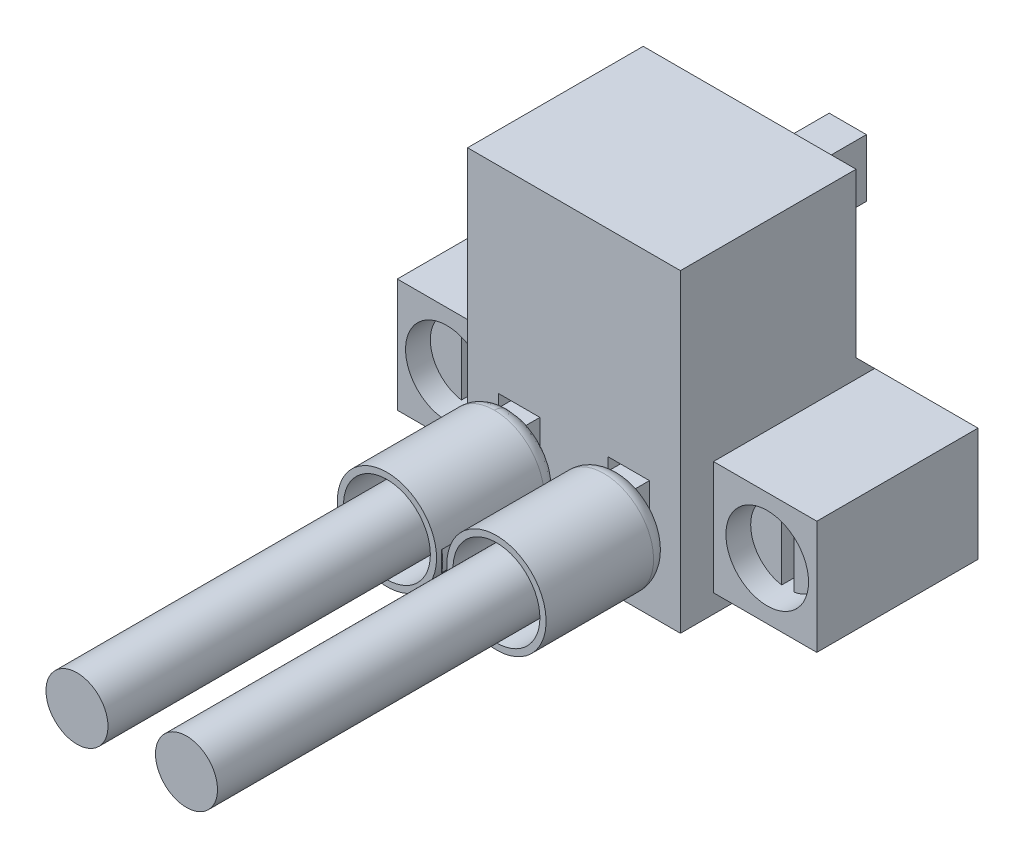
ISO-10303-21;
HEADER;
FILE_DESCRIPTION(('STEP AP214'),'2;1');
FILE_NAME('part.step','',(''),(''),'','','');
FILE_SCHEMA(('AUTOMOTIVE_DESIGN { 1 0 10303 214 1 1 1 1 }'));
ENDSEC;
DATA;
#1=APPLICATION_CONTEXT('core data for automotive mechanical design processes');
#2=APPLICATION_PROTOCOL_DEFINITION('international standard','automotive_design',2000,#1);
#3=PRODUCT_CONTEXT('',#1,'mechanical');
#4=PRODUCT('Part','Part','',(#3));
#5=PRODUCT_RELATED_PRODUCT_CATEGORY('part','',(#4));
#6=PRODUCT_DEFINITION_FORMATION('','',#4);
#7=PRODUCT_DEFINITION_CONTEXT('part definition',#1,'design');
#8=PRODUCT_DEFINITION('design','',#6,#7);
#9=PRODUCT_DEFINITION_SHAPE('','',#8);
#10=(LENGTH_UNIT() NAMED_UNIT(*) SI_UNIT(.MILLI.,.METRE.));
#11=(NAMED_UNIT(*) PLANE_ANGLE_UNIT() SI_UNIT($,.RADIAN.));
#12=(NAMED_UNIT(*) SI_UNIT($,.STERADIAN.) SOLID_ANGLE_UNIT());
#13=UNCERTAINTY_MEASURE_WITH_UNIT(LENGTH_MEASURE(1.E-05),#10,'distance_accuracy_value','');
#14=(GEOMETRIC_REPRESENTATION_CONTEXT(3) GLOBAL_UNCERTAINTY_ASSIGNED_CONTEXT((#13)) GLOBAL_UNIT_ASSIGNED_CONTEXT((#10,
#11,#12)) REPRESENTATION_CONTEXT('',''));
#15=CARTESIAN_POINT('',(0.,0.,0.));
#16=DIRECTION('',(0.,0.,1.));
#17=DIRECTION('',(1.,0.,0.));
#18=AXIS2_PLACEMENT_3D('',#15,#16,#17);
#19=CARTESIAN_POINT('',(5.48200000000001,2.382,43.));
#20=DIRECTION('',(0.,0.,1.));
#21=DIRECTION('',(1.,0.,0.));
#22=AXIS2_PLACEMENT_3D('',#19,#20,#21);
#23=PLANE('',#22);
#24=CARTESIAN_POINT('',(7.,3.9,43.));
#25=DIRECTION('',(0.,0.,-1.));
#26=DIRECTION('',(0.,1.,0.));
#27=AXIS2_PLACEMENT_3D('',#24,#25,#26);
#28=CIRCLE('',#27,1.5);
#29=CARTESIAN_POINT('',(7.,5.4,43.));
#30=VERTEX_POINT('',#29);
#31=EDGE_CURVE('E352',#30,#30,#28,.T.);
#32=ORIENTED_EDGE('',*,*,#31,.F.);
#33=EDGE_LOOP('',(#32));
#34=FACE_BOUND('',#33,.T.);
#35=ADVANCED_FACE('F53',(#34),#23,.T.);
#36=CARTESIAN_POINT('',(7.,3.9,43.));
#37=DIRECTION('',(0.,0.,-1.));
#38=DIRECTION('',(0.,1.,0.));
#39=AXIS2_PLACEMENT_3D('',#36,#37,#38);
#40=CYLINDRICAL_SURFACE('',#39,1.5);
#41=ORIENTED_EDGE('',*,*,#31,.T.);
#42=EDGE_LOOP('',(#41));
#43=FACE_BOUND('',#42,.T.);
#44=CARTESIAN_POINT('',(7.,3.89999999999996,23.));
#45=DIRECTION('',(0.,0.,-1.));
#46=DIRECTION('',(0.,1.,0.));
#47=AXIS2_PLACEMENT_3D('',#44,#45,#46);
#48=CIRCLE('',#47,1.5);
#49=CARTESIAN_POINT('',(7.,5.39999999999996,23.));
#50=VERTEX_POINT('',#49);
#51=EDGE_CURVE('E355',#50,#50,#48,.T.);
#52=ORIENTED_EDGE('',*,*,#51,.F.);
#53=EDGE_LOOP('',(#52));
#54=FACE_BOUND('',#53,.T.);
#55=ADVANCED_FACE('F1100',(#43,#54),#40,.T.);
#56=CARTESIAN_POINT('',(4.87480000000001,1.7748,23.));
#57=DIRECTION('',(0.,0.,1.));
#58=DIRECTION('',(1.,0.,0.));
#59=AXIS2_PLACEMENT_3D('',#56,#57,#58);
#60=PLANE('',#59);
#61=ORIENTED_EDGE('',*,*,#51,.T.);
#62=EDGE_LOOP('',(#61));
#63=FACE_BOUND('',#62,.T.);
#64=CARTESIAN_POINT('',(7.,3.9,23.));
#65=DIRECTION('',(0.,0.,1.));
#66=DIRECTION('',(1.,0.,0.));
#67=AXIS2_PLACEMENT_3D('',#64,#65,#66);
#68=CIRCLE('',#67,2.1);
#69=CARTESIAN_POINT('',(9.1,3.9,23.));
#70=VERTEX_POINT('',#69);
#71=EDGE_CURVE('E358',#70,#70,#68,.T.);
#72=ORIENTED_EDGE('',*,*,#71,.T.);
#73=EDGE_LOOP('',(#72));
#74=FACE_BOUND('',#73,.T.);
#75=ADVANCED_FACE('F1083',(#63,#74),#60,.T.);
#76=CARTESIAN_POINT('',(7.,3.9,23.));
#77=DIRECTION('',(0.,0.,1.));
#78=DIRECTION('',(1.,0.,0.));
#79=AXIS2_PLACEMENT_3D('',#76,#77,#78);
#80=CYLINDRICAL_SURFACE('',#79,2.1);
#81=ORIENTED_EDGE('',*,*,#71,.F.);
#82=EDGE_LOOP('',(#81));
#83=FACE_BOUND('',#82,.T.);
#84=CARTESIAN_POINT('',(7.,3.9,28.));
#85=DIRECTION('',(0.,0.,1.));
#86=DIRECTION('',(1.,0.,0.));
#87=AXIS2_PLACEMENT_3D('',#84,#85,#86);
#88=CIRCLE('',#87,2.1);
#89=CARTESIAN_POINT('',(9.1,3.9,28.));
#90=VERTEX_POINT('',#89);
#91=EDGE_CURVE('E361',#90,#90,#88,.F.);
#92=ORIENTED_EDGE('',*,*,#91,.F.);
#93=EDGE_LOOP('',(#92));
#94=FACE_BOUND('',#93,.T.);
#95=ADVANCED_FACE('F959',(#83,#94),#80,.F.);
#96=CARTESIAN_POINT('',(4.57120000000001,1.4712,28.));
#97=DIRECTION('',(0.,0.,1.));
#98=DIRECTION('',(1.,0.,0.));
#99=AXIS2_PLACEMENT_3D('',#96,#97,#98);
#100=PLANE('',#99);
#101=ORIENTED_EDGE('',*,*,#91,.T.);
#102=EDGE_LOOP('',(#101));
#103=FACE_BOUND('',#102,.T.);
#104=CARTESIAN_POINT('',(7.,3.9,28.));
#105=DIRECTION('',(0.,0.,-1.));
#106=DIRECTION('',(0.,1.,0.));
#107=AXIS2_PLACEMENT_3D('',#104,#105,#106);
#108=CIRCLE('',#107,2.4);
#109=CARTESIAN_POINT('',(7.,6.3,28.));
#110=VERTEX_POINT('',#109);
#111=EDGE_CURVE('E372',#110,#110,#108,.T.);
#112=ORIENTED_EDGE('',*,*,#111,.F.);
#113=EDGE_LOOP('',(#112));
#114=FACE_BOUND('',#113,.T.);
#115=ADVANCED_FACE('F951',(#103,#114),#100,.T.);
#116=CARTESIAN_POINT('',(1.6,2.0784,17.));
#117=DIRECTION('',(0.,0.,1.));
#118=DIRECTION('',(1.,0.,0.));
#119=AXIS2_PLACEMENT_3D('',#116,#117,#118);
#120=PLANE('',#119);
#121=CARTESIAN_POINT('',(1.90000000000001,3.9,16.9999999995));
#122=DIRECTION('',(0.,0.,-1.));
#123=DIRECTION('',(-1.,0.,0.));
#124=AXIS2_PLACEMENT_3D('',#121,#122,#123);
#125=CIRCLE('',#124,1.8);
#126=CARTESIAN_POINT('',(2.19999999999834,5.67482393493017,16.9999999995));
#127=VERTEX_POINT('',#126);
#128=CARTESIAN_POINT('',(1.60000000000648,5.67482393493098,16.9999999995));
#129=VERTEX_POINT('',#128);
#130=EDGE_CURVE('E364',#127,#129,#125,.F.);
#131=ORIENTED_EDGE('',*,*,#130,.T.);
#132=DIRECTION('',(0.,1.,0.));
#133=VECTOR('',#132,1.);
#134=CARTESIAN_POINT('',(1.6,2.125176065,16.9999999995));
#135=LINE('',#134,#133);
#136=CARTESIAN_POINT('',(1.5999999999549,2.12517606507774,16.9999999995));
#137=VERTEX_POINT('',#136);
#138=EDGE_CURVE('E369',#129,#137,#135,.F.);
#139=ORIENTED_EDGE('',*,*,#138,.T.);
#140=CARTESIAN_POINT('',(1.90000000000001,3.9,16.9999999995));
#141=DIRECTION('',(0.,0.,-1.));
#142=DIRECTION('',(-1.,0.,0.));
#143=AXIS2_PLACEMENT_3D('',#140,#141,#142);
#144=CIRCLE('',#143,1.8);
#145=CARTESIAN_POINT('',(2.20000000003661,2.1251760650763,16.9999999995));
#146=VERTEX_POINT('',#145);
#147=EDGE_CURVE('E365',#137,#146,#144,.F.);
#148=ORIENTED_EDGE('',*,*,#147,.T.);
#149=DIRECTION('',(0.,1.,0.));
#150=VECTOR('',#149,1.);
#151=CARTESIAN_POINT('',(2.20000000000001,2.125176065,16.9999999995));
#152=LINE('',#151,#150);
#153=EDGE_CURVE('E368',#146,#127,#152,.T.);
#154=ORIENTED_EDGE('',*,*,#153,.T.);
#155=EDGE_LOOP('',(#131,#139,#148,#154));
#156=FACE_BOUND('',#155,.T.);
#157=ADVANCED_FACE('F948',(#156),#120,.T.);
#158=CARTESIAN_POINT('',(7.,3.9,28.));
#159=DIRECTION('',(0.,0.,-1.));
#160=DIRECTION('',(0.,1.,0.));
#161=AXIS2_PLACEMENT_3D('',#158,#159,#160);
#162=CYLINDRICAL_SURFACE('',#161,2.4);
#163=CARTESIAN_POINT('',(7.,3.9,22.7999999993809));
#164=DIRECTION('',(0.,0.,-1.));
#165=DIRECTION('',(-1.,0.,0.));
#166=AXIS2_PLACEMENT_3D('',#163,#164,#165);
#167=CIRCLE('',#166,2.3999999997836);
#168=CARTESIAN_POINT('',(7.,1.5000000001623,22.799999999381));
#169=VERTEX_POINT('',#168);
#170=CARTESIAN_POINT('',(7.00000000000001,6.2999999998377,22.799999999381));
#171=VERTEX_POINT('',#170);
#172=EDGE_CURVE('E529',#169,#171,#167,.T.);
#173=ORIENTED_EDGE('',*,*,#172,.F.);
#174=CARTESIAN_POINT('',(7.,3.9,22.799999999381));
#175=DIRECTION('',(0.,0.,-1.));
#176=DIRECTION('',(-1.,0.,0.));
#177=AXIS2_PLACEMENT_3D('',#174,#175,#176);
#178=CIRCLE('',#177,2.3999999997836);
#179=EDGE_CURVE('E487',#171,#169,#178,.T.);
#180=ORIENTED_EDGE('',*,*,#179,.F.);
#181=EDGE_LOOP('',(#173,#180));
#182=FACE_BOUND('',#181,.T.);
#183=ORIENTED_EDGE('',*,*,#111,.T.);
#184=EDGE_LOOP('',(#183));
#185=FACE_BOUND('',#184,.T.);
#186=ADVANCED_FACE('F950',(#182,#185),#162,.T.);
#187=CARTESIAN_POINT('',(2.20000000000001,2.103878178,19.));
#188=DIRECTION('',(0.,0.,1.));
#189=DIRECTION('',(1.,0.,0.));
#190=AXIS2_PLACEMENT_3D('',#187,#188,#189);
#191=PLANE('',#190);
#192=DIRECTION('',(0.,1.,0.));
#193=VECTOR('',#192,1.);
#194=CARTESIAN_POINT('',(2.20000000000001,2.125176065,19.));
#195=LINE('',#194,#193);
#196=CARTESIAN_POINT('',(2.19999999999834,5.67482393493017,19.));
#197=VERTEX_POINT('',#196);
#198=CARTESIAN_POINT('',(2.20000000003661,2.1251760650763,19.));
#199=VERTEX_POINT('',#198);
#200=EDGE_CURVE('E375',#197,#199,#195,.F.);
#201=ORIENTED_EDGE('',*,*,#200,.T.);
#202=CARTESIAN_POINT('',(1.90000000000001,3.9,19.));
#203=DIRECTION('',(0.,0.,-1.));
#204=DIRECTION('',(-1.,0.,0.));
#205=AXIS2_PLACEMENT_3D('',#202,#203,#204);
#206=CIRCLE('',#205,1.8);
#207=EDGE_CURVE('E909',#197,#199,#206,.T.);
#208=ORIENTED_EDGE('',*,*,#207,.F.);
#209=EDGE_LOOP('',(#201,#208));
#210=FACE_BOUND('',#209,.T.);
#211=ADVANCED_FACE('F943',(#210),#191,.T.);
#212=CARTESIAN_POINT('',(2.20000000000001,2.125176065,19.));
#213=DIRECTION('',(1.,0.,0.));
#214=DIRECTION('',(0.,0.,-1.));
#215=AXIS2_PLACEMENT_3D('',#212,#213,#214);
#216=PLANE('',#215);
#217=DIRECTION('',(0.,0.,-1.));
#218=VECTOR('',#217,1.);
#219=CARTESIAN_POINT('',(2.20000000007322,2.12517606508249,19.));
#220=LINE('',#219,#218);
#221=EDGE_CURVE('E912',#199,#146,#220,.T.);
#222=ORIENTED_EDGE('',*,*,#221,.F.);
#223=ORIENTED_EDGE('',*,*,#200,.F.);
#224=DIRECTION('',(0.,0.,-1.));
#225=VECTOR('',#224,1.);
#226=CARTESIAN_POINT('',(2.19999999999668,5.67482393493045,19.));
#227=LINE('',#226,#225);
#228=EDGE_CURVE('E907',#127,#197,#227,.F.);
#229=ORIENTED_EDGE('',*,*,#228,.F.);
#230=ORIENTED_EDGE('',*,*,#153,.F.);
#231=EDGE_LOOP('',(#222,#223,#229,#230));
#232=FACE_BOUND('',#231,.T.);
#233=ADVANCED_FACE('F945',(#232),#216,.F.);
#234=CARTESIAN_POINT('',(1.6,2.125176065,17.));
#235=DIRECTION('',(-1.,0.,0.));
#236=DIRECTION('',(0.,0.,1.));
#237=AXIS2_PLACEMENT_3D('',#234,#235,#236);
#238=PLANE('',#237);
#239=DIRECTION('',(0.,0.,-1.));
#240=VECTOR('',#239,1.);
#241=CARTESIAN_POINT('',(1.60000000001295,5.67482393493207,19.));
#242=LINE('',#241,#240);
#243=CARTESIAN_POINT('',(1.5999999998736,5.67482393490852,19.));
#244=VERTEX_POINT('',#243);
#245=EDGE_CURVE('E550',#244,#129,#242,.T.);
#246=ORIENTED_EDGE('',*,*,#245,.F.);
#247=DIRECTION('',(0.,1.,0.));
#248=VECTOR('',#247,1.);
#249=CARTESIAN_POINT('',(1.59999999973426,2.103878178,19.));
#250=LINE('',#249,#248);
#251=CARTESIAN_POINT('',(1.59999999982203,2.1251760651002,19.));
#252=VERTEX_POINT('',#251);
#253=EDGE_CURVE('E418',#252,#244,#250,.T.);
#254=ORIENTED_EDGE('',*,*,#253,.F.);
#255=DIRECTION('',(0.,0.,-1.));
#256=VECTOR('',#255,1.);
#257=CARTESIAN_POINT('',(1.5999999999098,2.12517606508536,19.));
#258=LINE('',#257,#256);
#259=EDGE_CURVE('E915',#137,#252,#258,.F.);
#260=ORIENTED_EDGE('',*,*,#259,.F.);
#261=ORIENTED_EDGE('',*,*,#138,.F.);
#262=EDGE_LOOP('',(#246,#254,#260,#261));
#263=FACE_BOUND('',#262,.T.);
#264=ADVANCED_FACE('F935',(#263),#238,.F.);
#265=CARTESIAN_POINT('',(0.0910000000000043,2.103878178,19.));
#266=DIRECTION('',(0.,0.,1.));
#267=DIRECTION('',(1.,0.,0.));
#268=AXIS2_PLACEMENT_3D('',#265,#266,#267);
#269=PLANE('',#268);
#270=ORIENTED_EDGE('',*,*,#253,.T.);
#271=CARTESIAN_POINT('',(1.90000000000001,3.9,19.));
#272=DIRECTION('',(0.,0.,-1.));
#273=DIRECTION('',(-1.,0.,0.));
#274=AXIS2_PLACEMENT_3D('',#271,#272,#273);
#275=CIRCLE('',#274,1.8);
#276=EDGE_CURVE('E556',#252,#244,#275,.T.);
#277=ORIENTED_EDGE('',*,*,#276,.F.);
#278=EDGE_LOOP('',(#270,#277));
#279=FACE_BOUND('',#278,.T.);
#280=ADVANCED_FACE('F931',(#279),#269,.T.);
#281=CARTESIAN_POINT('',(7.,6.296003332,22.879866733));
#282=CARTESIAN_POINT('',(2.20799333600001,6.296003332,22.879866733));
#283=CARTESIAN_POINT('',(2.20799333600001,1.503996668,22.879866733));
#284=CARTESIAN_POINT('',(7.,1.503996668,22.879866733));
#285=CARTESIAN_POINT('',(7.00000000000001,6.350576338,22.335956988));
#286=CARTESIAN_POINT('',(2.09884732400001,6.350576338,22.335956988));
#287=CARTESIAN_POINT('',(2.09884732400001,1.449423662,22.335956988));
#288=CARTESIAN_POINT('',(7.00000000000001,1.449423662,22.335956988));
#289=CARTESIAN_POINT('',(7.00000000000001,5.964043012,21.949423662));
#290=CARTESIAN_POINT('',(2.87191397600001,5.964043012,21.949423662));
#291=CARTESIAN_POINT('',(2.87191397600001,1.835956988,21.949423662));
#292=CARTESIAN_POINT('',(7.00000000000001,1.835956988,21.949423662));
#293=CARTESIAN_POINT('',(7.,5.420133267,22.003996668));
#294=CARTESIAN_POINT('',(3.95973346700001,5.420133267,22.003996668));
#295=CARTESIAN_POINT('',(3.95973346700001,2.379866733,22.003996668));
#296=CARTESIAN_POINT('',(7.,2.379866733,22.003996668));
#297=(BOUNDED_SURFACE() B_SPLINE_SURFACE(3,3,((#281,#282,#283,#284),(#285,#286,#287,#288),(#289,
#290,#291,#292),(#293,#294,#295,#296)),.UNSPECIFIED.,.F.,.F.,
.F.) B_SPLINE_SURFACE_WITH_KNOTS((4,4),(4,4),(0.,1.),(0.,1.),
.UNSPECIFIED.) GEOMETRIC_REPRESENTATION_ITEM() RATIONAL_B_SPLINE_SURFACE(((1.,0.333333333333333,
0.333333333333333,1.),(0.755320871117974,0.251773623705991,0.251773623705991,0.755320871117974),
(0.755320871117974,0.251773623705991,0.251773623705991,0.755320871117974),(1.,0.333333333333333,
0.333333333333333,1.))) REPRESENTATION_ITEM('') SURFACE());
#298=CARTESIAN_POINT('',(6.3,5.59999999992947,22.0363715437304));
#299=CARTESIAN_POINT('',(6.30000000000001,5.58582211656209,22.0322770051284));
#300=CARTESIAN_POINT('',(6.30000000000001,5.57154387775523,22.028532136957));
#301=CARTESIAN_POINT('',(6.30000000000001,5.54288616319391,22.0217538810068));
#302=CARTESIAN_POINT('',(6.30000000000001,5.52850741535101,22.0187174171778));
#303=CARTESIAN_POINT('',(6.30000000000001,5.49965296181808,22.0133376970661));
#304=CARTESIAN_POINT('',(6.30000000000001,5.48517753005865,22.0109929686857));
#305=CARTESIAN_POINT('',(6.30000000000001,5.45613440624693,22.0069826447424));
#306=CARTESIAN_POINT('',(6.30000000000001,5.44156672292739,22.005316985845));
#307=CARTESIAN_POINT('',(6.30000000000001,5.41233768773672,22.002654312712));
#308=CARTESIAN_POINT('',(6.30000000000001,5.39767619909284,22.0016588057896));
#309=CARTESIAN_POINT('',(6.30000000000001,5.36825953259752,22.0003300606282));
#310=CARTESIAN_POINT('',(6.30000000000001,5.35350422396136,21.9999997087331));
#311=CARTESIAN_POINT('',(6.30000000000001,5.33874945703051,22.0000000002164));
#312=B_SPLINE_CURVE_WITH_KNOTS('',3,(#298,#299,#300,#301,#302,#303,#304,#305,#306,#307,#308,
#309,#310,#311),.UNSPECIFIED.,.F.,.F.,(4,2,2,2,2,2,4),(0.,0.0442665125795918,0.0883370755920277,
0.13231316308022,0.176285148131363,0.220355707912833,0.264617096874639),.UNSPECIFIED.);
#313=CARTESIAN_POINT('',(6.30000000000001,5.59999999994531,22.0363715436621));
#314=VERTEX_POINT('',#313);
#315=CARTESIAN_POINT('',(6.29999999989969,5.3387494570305,22.0000000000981));
#316=VERTEX_POINT('',#315);
#317=EDGE_CURVE('E414',#314,#316,#312,.T.);
#318=CARTESIAN_POINT('',(7.,5.50000000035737,22.0000000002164));
#319=CARTESIAN_POINT('',(3.80000000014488,5.50000000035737,22.0000000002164));
#320=CARTESIAN_POINT('',(3.80000000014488,2.29999999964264,22.0000000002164));
#321=CARTESIAN_POINT('',(7.,2.29999999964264,22.0000000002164));
#322=(BOUNDED_CURVE() B_SPLINE_CURVE(3,(#318,#319,#320,#321),.UNSPECIFIED.,.F.,
.F.) B_SPLINE_CURVE_WITH_KNOTS((4,4),(0.,1.),
.UNSPECIFIED.) CURVE() GEOMETRIC_REPRESENTATION_ITEM() RATIONAL_B_SPLINE_CURVE((0.956578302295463,
0.318859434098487,0.318859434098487,0.956578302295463)) REPRESENTATION_ITEM(''));
#323=CARTESIAN_POINT('',(6.29999999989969,2.4612505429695,22.0000000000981));
#324=VERTEX_POINT('',#323);
#325=EDGE_CURVE('E417',#316,#324,#322,.T.);
#326=CARTESIAN_POINT('',(6.30000000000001,2.4612505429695,22.0000000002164));
#327=CARTESIAN_POINT('',(6.30000000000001,2.44649577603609,21.9999997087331));
#328=CARTESIAN_POINT('',(6.30000000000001,2.43174046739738,22.0003300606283));
#329=CARTESIAN_POINT('',(6.30000000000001,2.40232380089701,22.0016588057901));
#330=CARTESIAN_POINT('',(6.30000000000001,2.38766231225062,22.0026543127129));
#331=CARTESIAN_POINT('',(6.30000000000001,2.358433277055,22.0053169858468));
#332=CARTESIAN_POINT('',(6.30000000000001,2.343865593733,22.0069826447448));
#333=CARTESIAN_POINT('',(6.30000000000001,2.31482246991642,22.0109929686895));
#334=CARTESIAN_POINT('',(6.30000000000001,2.30034703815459,22.0133376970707));
#335=CARTESIAN_POINT('',(6.30000000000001,2.2714925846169,22.0187174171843));
#336=CARTESIAN_POINT('',(6.30000000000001,2.25711383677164,22.0217538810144));
#337=CARTESIAN_POINT('',(6.30000000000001,2.22845612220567,22.0285321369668));
#338=CARTESIAN_POINT('',(6.30000000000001,2.21417788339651,22.0322770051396));
#339=CARTESIAN_POINT('',(6.30000000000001,2.20000000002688,22.036371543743));
#340=B_SPLINE_CURVE_WITH_KNOTS('',3,(#326,#327,#328,#329,#330,#331,#332,#333,#334,#335,#336,
#337,#338,#339),.UNSPECIFIED.,.F.,.F.,(4,2,2,2,2,2,4),(0.,0.0442613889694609,0.0883319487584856,
0.13230393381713,0.176280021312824,0.220350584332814,0.264617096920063),.UNSPECIFIED.);
#341=CARTESIAN_POINT('',(6.30000000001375,2.19999999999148,22.0363715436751));
#342=VERTEX_POINT('',#341);
#343=EDGE_CURVE('E383',#324,#342,#340,.T.);
#344=CARTESIAN_POINT('',(6.30000000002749,2.2,22.0363715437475));
#345=CARTESIAN_POINT('',(6.33871248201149,2.2,22.0317772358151));
#346=CARTESIAN_POINT('',(6.37750458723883,2.2,22.0279508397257));
#347=CARTESIAN_POINT('',(6.45515573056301,2.2,22.0215258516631));
#348=CARTESIAN_POINT('',(6.49401467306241,2.2,22.0189261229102));
#349=CARTESIAN_POINT('',(6.57177265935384,2.2,22.0146394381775));
#350=CARTESIAN_POINT('',(6.61067169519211,2.2,22.0129523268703));
#351=CARTESIAN_POINT('',(6.68848137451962,2.2,22.0102478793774));
#352=CARTESIAN_POINT('',(6.72739201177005,2.2,22.0092303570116));
#353=CARTESIAN_POINT('',(6.80523943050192,2.2,22.0076749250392));
#354=CARTESIAN_POINT('',(6.84417621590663,2.2,22.0071372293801));
#355=CARTESIAN_POINT('',(6.92207561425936,2.2,22.0064437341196));
#356=CARTESIAN_POINT('',(6.96103822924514,2.2,22.0062881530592));
#357=CARTESIAN_POINT('',(7.,2.2,22.0062746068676));
#358=B_SPLINE_CURVE_WITH_KNOTS('',3,(#344,#345,#346,#347,#348,#349,#350,#351,#352,#353,#354,
#355,#356,#357),.UNSPECIFIED.,.F.,.F.,(4,2,2,2,2,2,4),(0.,0.116928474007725,0.233748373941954,
0.350548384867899,0.467315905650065,0.584135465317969,0.70102182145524),.UNSPECIFIED.);
#359=CARTESIAN_POINT('',(7.00000000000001,2.19999999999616,22.0062746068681));
#360=VERTEX_POINT('',#359);
#361=EDGE_CURVE('E524',#342,#360,#358,.T.);
#362=CARTESIAN_POINT('',(7.,1.503996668,22.879866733));
#363=CARTESIAN_POINT('',(7.,1.449423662,22.335956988));
#364=CARTESIAN_POINT('',(7.,1.835956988,21.949423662));
#365=CARTESIAN_POINT('',(7.,2.379866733,22.003996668));
#366=(BOUNDED_CURVE() B_SPLINE_CURVE(3,(#362,#363,#364,#365),.UNSPECIFIED.,.F.,
.F.) B_SPLINE_CURVE_WITH_KNOTS((4,4),(0.,1.),
.UNSPECIFIED.) CURVE() GEOMETRIC_REPRESENTATION_ITEM() RATIONAL_B_SPLINE_CURVE((1.,
0.755320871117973,0.755320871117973,1.)) REPRESENTATION_ITEM(''));
#367=EDGE_CURVE('E483',#169,#360,#366,.T.);
#368=CARTESIAN_POINT('',(7.,6.296003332,22.879866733));
#369=CARTESIAN_POINT('',(7.,6.350576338,22.335956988));
#370=CARTESIAN_POINT('',(7.,5.964043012,21.949423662));
#371=CARTESIAN_POINT('',(7.,5.420133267,22.003996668));
#372=(BOUNDED_CURVE() B_SPLINE_CURVE(3,(#368,#369,#370,#371),.UNSPECIFIED.,.F.,
.F.) B_SPLINE_CURVE_WITH_KNOTS((4,4),(0.,1.),
.UNSPECIFIED.) CURVE() GEOMETRIC_REPRESENTATION_ITEM() RATIONAL_B_SPLINE_CURVE((1.,
0.755320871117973,0.755320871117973,1.)) REPRESENTATION_ITEM(''));
#373=CARTESIAN_POINT('',(7.,5.6,22.0062746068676));
#374=VERTEX_POINT('',#373);
#375=EDGE_CURVE('E475',#374,#171,#372,.F.);
#376=CARTESIAN_POINT('',(7.,5.6,22.0062746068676));
#377=CARTESIAN_POINT('',(6.96103822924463,5.6,22.0062881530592));
#378=CARTESIAN_POINT('',(6.92207561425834,5.6,22.0064437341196));
#379=CARTESIAN_POINT('',(6.8441762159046,5.6,22.0071372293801));
#380=CARTESIAN_POINT('',(6.80523943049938,5.6,22.0076749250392));
#381=CARTESIAN_POINT('',(6.7273920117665,5.6,22.0092303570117));
#382=CARTESIAN_POINT('',(6.68848137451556,5.6,22.0102478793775));
#383=CARTESIAN_POINT('',(6.61067169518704,5.6,22.0129523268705));
#384=CARTESIAN_POINT('',(6.57177265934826,5.6,22.0146394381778));
#385=CARTESIAN_POINT('',(6.49401467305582,5.6,22.0189261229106));
#386=CARTESIAN_POINT('',(6.45515573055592,5.6,22.0215258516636));
#387=CARTESIAN_POINT('',(6.37750458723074,5.6,22.0279508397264));
#388=CARTESIAN_POINT('',(6.3387124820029,5.6,22.0317772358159));
#389=CARTESIAN_POINT('',(6.30000000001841,5.6,22.0363715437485));
#390=B_SPLINE_CURVE_WITH_KNOTS('',3,(#376,#377,#378,#379,#380,#381,#382,#383,#384,#385,#386,
#387,#388,#389),.UNSPECIFIED.,.F.,.F.,(4,2,2,2,2,2,4),(0.,0.1168863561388,0.233705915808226,
0.35047343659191,0.467273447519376,0.584093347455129,0.701021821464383),.UNSPECIFIED.);
#391=EDGE_CURVE('E410',#374,#314,#390,.T.);
#392=ORIENTED_EDGE('',*,*,#317,.T.);
#393=ORIENTED_EDGE('',*,*,#325,.T.);
#394=ORIENTED_EDGE('',*,*,#343,.T.);
#395=ORIENTED_EDGE('',*,*,#361,.T.);
#396=ORIENTED_EDGE('',*,*,#367,.F.);
#397=ORIENTED_EDGE('',*,*,#172,.T.);
#398=ORIENTED_EDGE('',*,*,#375,.F.);
#399=ORIENTED_EDGE('',*,*,#391,.T.);
#400=EDGE_LOOP('',(#392,#393,#394,#395,#396,#397,#398,#399));
#401=FACE_BOUND('',#400,.T.);
#402=ADVANCED_FACE('F385',(#401),#297,.T.);
#403=CARTESIAN_POINT('',(7.,1.503996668,22.879866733));
#404=CARTESIAN_POINT('',(11.792006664,1.503996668,22.879866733));
#405=CARTESIAN_POINT('',(11.792006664,6.296003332,22.879866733));
#406=CARTESIAN_POINT('',(7.,6.296003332,22.879866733));
#407=CARTESIAN_POINT('',(7.,1.449423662,22.335956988));
#408=CARTESIAN_POINT('',(11.901152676,1.449423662,22.335956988));
#409=CARTESIAN_POINT('',(11.901152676,6.350576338,22.335956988));
#410=CARTESIAN_POINT('',(7.,6.350576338,22.335956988));
#411=CARTESIAN_POINT('',(7.,1.835956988,21.949423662));
#412=CARTESIAN_POINT('',(11.128086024,1.835956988,21.949423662));
#413=CARTESIAN_POINT('',(11.128086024,5.964043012,21.949423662));
#414=CARTESIAN_POINT('',(7.,5.964043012,21.949423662));
#415=CARTESIAN_POINT('',(7.,2.379866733,22.003996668));
#416=CARTESIAN_POINT('',(10.040266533,2.379866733,22.003996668));
#417=CARTESIAN_POINT('',(10.040266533,5.420133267,22.003996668));
#418=CARTESIAN_POINT('',(7.,5.420133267,22.003996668));
#419=(BOUNDED_SURFACE() B_SPLINE_SURFACE(3,3,((#403,#404,#405,#406),(#407,#408,#409,#410),(#411,
#412,#413,#414),(#415,#416,#417,#418)),.UNSPECIFIED.,.F.,.F.,
.F.) B_SPLINE_SURFACE_WITH_KNOTS((4,4),(4,4),(0.,1.),(0.,1.),
.UNSPECIFIED.) GEOMETRIC_REPRESENTATION_ITEM() RATIONAL_B_SPLINE_SURFACE(((1.,0.333333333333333,
0.333333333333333,1.),(0.755320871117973,0.251773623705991,0.251773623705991,0.755320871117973),
(0.755320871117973,0.251773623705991,0.251773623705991,0.755320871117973),(1.,0.333333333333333,
0.333333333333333,1.))) REPRESENTATION_ITEM('') SURFACE());
#420=CARTESIAN_POINT('',(7.00000000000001,2.2,22.0062746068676));
#421=CARTESIAN_POINT('',(7.03896177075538,2.2,22.0062881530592));
#422=CARTESIAN_POINT('',(7.07792438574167,2.2,22.0064437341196));
#423=CARTESIAN_POINT('',(7.15582378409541,2.2,22.0071372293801));
#424=CARTESIAN_POINT('',(7.19476056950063,2.2,22.0076749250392));
#425=CARTESIAN_POINT('',(7.27260798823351,2.2,22.0092303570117));
#426=CARTESIAN_POINT('',(7.31151862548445,2.2,22.0102478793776));
#427=CARTESIAN_POINT('',(7.38932830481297,2.2,22.0129523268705));
#428=CARTESIAN_POINT('',(7.42822734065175,2.2,22.0146394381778));
#429=CARTESIAN_POINT('',(7.50598532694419,2.2,22.0189261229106));
#430=CARTESIAN_POINT('',(7.54484426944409,2.2,22.0215258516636));
#431=CARTESIAN_POINT('',(7.62249541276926,2.2,22.0279508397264));
#432=CARTESIAN_POINT('',(7.66128751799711,2.2,22.031777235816));
#433=CARTESIAN_POINT('',(7.6999999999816,2.2,22.0363715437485));
#434=B_SPLINE_CURVE_WITH_KNOTS('',3,(#420,#421,#422,#423,#424,#425,#426,#427,#428,#429,#430,
#431,#432,#433),.UNSPECIFIED.,.F.,.F.,(4,2,2,2,2,2,4),(0.,0.116886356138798,0.233705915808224,
0.350473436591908,0.467273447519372,0.584093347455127,0.701021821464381),.UNSPECIFIED.);
#435=CARTESIAN_POINT('',(7.6999999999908,2.20000000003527,22.0363715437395));
#436=VERTEX_POINT('',#435);
#437=EDGE_CURVE('E450',#360,#436,#434,.T.);
#438=CARTESIAN_POINT('',(7.7,2.20000000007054,22.0363715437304));
#439=CARTESIAN_POINT('',(7.7,2.21417788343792,22.0322770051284));
#440=CARTESIAN_POINT('',(7.7,2.22845612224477,22.028532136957));
#441=CARTESIAN_POINT('',(7.7,2.25711383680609,22.0217538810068));
#442=CARTESIAN_POINT('',(7.7,2.27149258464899,22.0187174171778));
#443=CARTESIAN_POINT('',(7.7,2.30034703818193,22.0133376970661));
#444=CARTESIAN_POINT('',(7.7,2.31482246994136,22.0109929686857));
#445=CARTESIAN_POINT('',(7.7,2.34386559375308,22.0069826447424));
#446=CARTESIAN_POINT('',(7.7,2.35843327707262,22.005316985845));
#447=CARTESIAN_POINT('',(7.7,2.38766231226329,22.002654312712));
#448=CARTESIAN_POINT('',(7.7,2.40232380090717,22.0016588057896));
#449=CARTESIAN_POINT('',(7.7,2.43174046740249,22.0003300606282));
#450=CARTESIAN_POINT('',(7.7,2.44649577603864,21.9999997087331));
#451=CARTESIAN_POINT('',(7.7,2.4612505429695,22.0000000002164));
#452=B_SPLINE_CURVE_WITH_KNOTS('',3,(#438,#439,#440,#441,#442,#443,#444,#445,#446,#447,#448,
#449,#450,#451),.UNSPECIFIED.,.F.,.F.,(4,2,2,2,2,2,4),(0.,0.0442665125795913,0.0883370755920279,
0.13231316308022,0.176285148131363,0.220355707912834,0.26461709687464),.UNSPECIFIED.);
#453=CARTESIAN_POINT('',(7.70000000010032,2.4612505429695,22.0000000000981));
#454=VERTEX_POINT('',#453);
#455=EDGE_CURVE('E424',#436,#454,#452,.T.);
#456=CARTESIAN_POINT('',(7.,2.29999999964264,22.0000000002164));
#457=CARTESIAN_POINT('',(10.1999999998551,2.29999999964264,22.0000000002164));
#458=CARTESIAN_POINT('',(10.1999999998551,5.50000000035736,22.0000000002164));
#459=CARTESIAN_POINT('',(7.,5.50000000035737,22.0000000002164));
#460=(BOUNDED_CURVE() B_SPLINE_CURVE(3,(#456,#457,#458,#459),.UNSPECIFIED.,.F.,
.F.) B_SPLINE_CURVE_WITH_KNOTS((4,4),(0.,1.),
.UNSPECIFIED.) CURVE() GEOMETRIC_REPRESENTATION_ITEM() RATIONAL_B_SPLINE_CURVE((0.956578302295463,
0.318859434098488,0.318859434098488,0.956578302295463)) REPRESENTATION_ITEM(''));
#461=CARTESIAN_POINT('',(7.70000000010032,5.3387494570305,22.0000000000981));
#462=VERTEX_POINT('',#461);
#463=EDGE_CURVE('E470',#454,#462,#460,.T.);
#464=CARTESIAN_POINT('',(7.7,5.3387494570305,22.0000000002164));
#465=CARTESIAN_POINT('',(7.7,5.35350422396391,21.9999997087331));
#466=CARTESIAN_POINT('',(7.7,5.36825953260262,22.0003300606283));
#467=CARTESIAN_POINT('',(7.7,5.39767619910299,22.0016588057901));
#468=CARTESIAN_POINT('',(7.7,5.41233768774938,22.0026543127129));
#469=CARTESIAN_POINT('',(7.7,5.441566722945,22.0053169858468));
#470=CARTESIAN_POINT('',(7.7,5.456134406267,22.0069826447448));
#471=CARTESIAN_POINT('',(7.7,5.48517753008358,22.0109929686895));
#472=CARTESIAN_POINT('',(7.7,5.49965296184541,22.0133376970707));
#473=CARTESIAN_POINT('',(7.7,5.5285074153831,22.0187174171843));
#474=CARTESIAN_POINT('',(7.7,5.54288616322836,22.0217538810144));
#475=CARTESIAN_POINT('',(7.7,5.57154387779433,22.0285321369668));
#476=CARTESIAN_POINT('',(7.7,5.58582211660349,22.0322770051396));
#477=CARTESIAN_POINT('',(7.70000000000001,5.59999999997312,22.036371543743));
#478=B_SPLINE_CURVE_WITH_KNOTS('',3,(#464,#465,#466,#467,#468,#469,#470,#471,#472,#473,#474,
#475,#476,#477),.UNSPECIFIED.,.F.,.F.,(4,2,2,2,2,2,4),(0.,0.0442613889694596,0.0883319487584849,
0.132303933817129,0.176280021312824,0.220350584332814,0.264617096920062),.UNSPECIFIED.);
#479=CARTESIAN_POINT('',(7.69999999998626,5.60000000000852,22.0363715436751));
#480=VERTEX_POINT('',#479);
#481=EDGE_CURVE('E468',#462,#480,#478,.T.);
#482=CARTESIAN_POINT('',(7.69999999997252,5.6,22.0363715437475));
#483=CARTESIAN_POINT('',(7.66128751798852,5.6,22.031777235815));
#484=CARTESIAN_POINT('',(7.62249541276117,5.6,22.0279508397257));
#485=CARTESIAN_POINT('',(7.544844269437,5.6,22.0215258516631));
#486=CARTESIAN_POINT('',(7.5059853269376,5.6,22.0189261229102));
#487=CARTESIAN_POINT('',(7.42822734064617,5.6,22.0146394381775));
#488=CARTESIAN_POINT('',(7.3893283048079,5.6,22.0129523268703));
#489=CARTESIAN_POINT('',(7.31151862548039,5.6,22.0102478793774));
#490=CARTESIAN_POINT('',(7.27260798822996,5.6,22.0092303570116));
#491=CARTESIAN_POINT('',(7.19476056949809,5.6,22.0076749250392));
#492=CARTESIAN_POINT('',(7.15582378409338,5.6,22.0071372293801));
#493=CARTESIAN_POINT('',(7.07792438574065,5.6,22.0064437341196));
#494=CARTESIAN_POINT('',(7.03896177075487,5.6,22.0062881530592));
#495=CARTESIAN_POINT('',(7.,5.6,22.0062746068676));
#496=B_SPLINE_CURVE_WITH_KNOTS('',3,(#482,#483,#484,#485,#486,#487,#488,#489,#490,#491,#492,
#493,#494,#495),.UNSPECIFIED.,.F.,.F.,(4,2,2,2,2,2,4),(0.,0.116928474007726,0.233748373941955,
0.350548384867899,0.467315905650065,0.584135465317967,0.701021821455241),.UNSPECIFIED.);
#497=EDGE_CURVE('E458',#480,#374,#496,.T.);
#498=ORIENTED_EDGE('',*,*,#179,.T.);
#499=ORIENTED_EDGE('',*,*,#367,.T.);
#500=ORIENTED_EDGE('',*,*,#437,.T.);
#501=ORIENTED_EDGE('',*,*,#455,.T.);
#502=ORIENTED_EDGE('',*,*,#463,.T.);
#503=ORIENTED_EDGE('',*,*,#481,.T.);
#504=ORIENTED_EDGE('',*,*,#497,.T.);
#505=ORIENTED_EDGE('',*,*,#375,.T.);
#506=EDGE_LOOP('',(#498,#499,#500,#501,#502,#503,#504,#505));
#507=FACE_BOUND('',#506,.T.);
#508=ADVANCED_FACE('F426',(#507),#419,.T.);
#509=CARTESIAN_POINT('',(1.90000000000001,3.9,19.));
#510=DIRECTION('',(0.,0.,-1.));
#511=DIRECTION('',(-1.,0.,0.));
#512=AXIS2_PLACEMENT_3D('',#509,#510,#511);
#513=CYLINDRICAL_SURFACE('',#512,1.8);
#514=ORIENTED_EDGE('',*,*,#228,.T.);
#515=ORIENTED_EDGE('',*,*,#207,.T.);
#516=ORIENTED_EDGE('',*,*,#221,.T.);
#517=ORIENTED_EDGE('',*,*,#147,.F.);
#518=ORIENTED_EDGE('',*,*,#259,.T.);
#519=ORIENTED_EDGE('',*,*,#276,.T.);
#520=ORIENTED_EDGE('',*,*,#245,.T.);
#521=ORIENTED_EDGE('',*,*,#130,.F.);
#522=EDGE_LOOP('',(#514,#515,#516,#517,#518,#519,#520,#521));
#523=FACE_BOUND('',#522,.T.);
#524=CARTESIAN_POINT('',(1.90000000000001,3.9,16.));
#525=DIRECTION('',(0.,0.,-1.));
#526=DIRECTION('',(-1.,0.,0.));
#527=AXIS2_PLACEMENT_3D('',#524,#525,#526);
#528=CIRCLE('',#527,1.8);
#529=CARTESIAN_POINT('',(0.100000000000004,3.9,16.));
#530=VERTEX_POINT('',#529);
#531=EDGE_CURVE('E577',#530,#530,#528,.T.);
#532=ORIENTED_EDGE('',*,*,#531,.F.);
#533=EDGE_LOOP('',(#532));
#534=FACE_BOUND('',#533,.T.);
#535=ADVANCED_FACE('F432',(#523,#534),#513,.T.);
#536=CARTESIAN_POINT('',(5.39460000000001,2.44398555,22.));
#537=DIRECTION('',(0.,0.,1.));
#538=DIRECTION('',(1.,0.,0.));
#539=AXIS2_PLACEMENT_3D('',#536,#537,#538);
#540=PLANE('',#539);
#541=DIRECTION('',(0.,1.,0.));
#542=VECTOR('',#541,1.);
#543=CARTESIAN_POINT('',(6.30000000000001,2.2,22.000000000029));
#544=LINE('',#543,#542);
#545=EDGE_CURVE('E548',#316,#324,#544,.F.);
#546=ORIENTED_EDGE('',*,*,#545,.T.);
#547=ORIENTED_EDGE('',*,*,#325,.F.);
#548=EDGE_LOOP('',(#546,#547));
#549=FACE_BOUND('',#548,.T.);
#550=ADVANCED_FACE('F507',(#549),#540,.F.);
#551=CARTESIAN_POINT('',(7.7,2.2,20.));
#552=DIRECTION('',(0.,1.,0.));
#553=DIRECTION('',(0.,0.,1.));
#554=AXIS2_PLACEMENT_3D('',#551,#552,#553);
#555=PLANE('',#554);
#556=ORIENTED_EDGE('',*,*,#361,.F.);
#557=DIRECTION('',(0.,0.,-1.));
#558=VECTOR('',#557,1.);
#559=CARTESIAN_POINT('',(6.30000000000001,2.19999999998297,20.));
#560=LINE('',#559,#558);
#561=CARTESIAN_POINT('',(6.30000000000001,2.19999999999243,20.));
#562=VERTEX_POINT('',#561);
#563=EDGE_CURVE('E549',#342,#562,#560,.T.);
#564=ORIENTED_EDGE('',*,*,#563,.T.);
#565=DIRECTION('',(1.,0.,0.));
#566=VECTOR('',#565,1.);
#567=CARTESIAN_POINT('',(7.7,2.2,20.));
#568=LINE('',#567,#566);
#569=CARTESIAN_POINT('',(7.7,2.2,20.));
#570=VERTEX_POINT('',#569);
#571=EDGE_CURVE('E588',#570,#562,#568,.F.);
#572=ORIENTED_EDGE('',*,*,#571,.F.);
#573=DIRECTION('',(0.,0.,1.));
#574=VECTOR('',#573,1.);
#575=CARTESIAN_POINT('',(7.7,2.2,20.));
#576=LINE('',#575,#574);
#577=EDGE_CURVE('E553',#570,#436,#576,.T.);
#578=ORIENTED_EDGE('',*,*,#577,.T.);
#579=ORIENTED_EDGE('',*,*,#437,.F.);
#580=EDGE_LOOP('',(#556,#564,#572,#578,#579));
#581=FACE_BOUND('',#580,.T.);
#582=ADVANCED_FACE('F515',(#581),#555,.F.);
#583=CARTESIAN_POINT('',(7.7,2.44398555,22.));
#584=DIRECTION('',(0.,0.,1.));
#585=DIRECTION('',(1.,0.,0.));
#586=AXIS2_PLACEMENT_3D('',#583,#584,#585);
#587=PLANE('',#586);
#588=DIRECTION('',(0.,1.,0.));
#589=VECTOR('',#588,1.);
#590=CARTESIAN_POINT('',(7.7,5.6,22.000000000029));
#591=LINE('',#590,#589);
#592=EDGE_CURVE('E563',#454,#462,#591,.T.);
#593=ORIENTED_EDGE('',*,*,#592,.T.);
#594=ORIENTED_EDGE('',*,*,#463,.F.);
#595=EDGE_LOOP('',(#593,#594));
#596=FACE_BOUND('',#595,.T.);
#597=ADVANCED_FACE('F520',(#596),#587,.F.);
#598=CARTESIAN_POINT('',(6.30000000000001,5.6,20.));
#599=DIRECTION('',(0.,-1.,0.));
#600=DIRECTION('',(0.,0.,-1.));
#601=AXIS2_PLACEMENT_3D('',#598,#599,#600);
#602=PLANE('',#601);
#603=ORIENTED_EDGE('',*,*,#497,.F.);
#604=DIRECTION('',(0.,0.,1.));
#605=VECTOR('',#604,1.);
#606=CARTESIAN_POINT('',(7.7,5.60000000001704,20.));
#607=LINE('',#606,#605);
#608=CARTESIAN_POINT('',(7.7,5.60000000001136,20.));
#609=VERTEX_POINT('',#608);
#610=EDGE_CURVE('E567',#480,#609,#607,.F.);
#611=ORIENTED_EDGE('',*,*,#610,.T.);
#612=DIRECTION('',(1.,0.,0.));
#613=VECTOR('',#612,1.);
#614=CARTESIAN_POINT('',(6.30000000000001,5.6,20.));
#615=LINE('',#614,#613);
#616=CARTESIAN_POINT('',(6.30000000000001,5.6,20.));
#617=VERTEX_POINT('',#616);
#618=EDGE_CURVE('E582',#617,#609,#615,.T.);
#619=ORIENTED_EDGE('',*,*,#618,.F.);
#620=DIRECTION('',(0.,0.,-1.));
#621=VECTOR('',#620,1.);
#622=CARTESIAN_POINT('',(6.30000000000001,5.6,20.));
#623=LINE('',#622,#621);
#624=EDGE_CURVE('E569',#617,#314,#623,.F.);
#625=ORIENTED_EDGE('',*,*,#624,.T.);
#626=ORIENTED_EDGE('',*,*,#391,.F.);
#627=EDGE_LOOP('',(#603,#611,#619,#625,#626));
#628=FACE_BOUND('',#627,.T.);
#629=ADVANCED_FACE('F884',(#628),#602,.F.);
#630=CARTESIAN_POINT('',(-0.123999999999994,1.876,16.));
#631=DIRECTION('',(0.,0.,1.));
#632=DIRECTION('',(1.,0.,0.));
#633=AXIS2_PLACEMENT_3D('',#630,#631,#632);
#634=PLANE('',#633);
#635=ORIENTED_EDGE('',*,*,#531,.T.);
#636=EDGE_LOOP('',(#635));
#637=FACE_BOUND('',#636,.T.);
#638=CARTESIAN_POINT('',(1.9,3.9,16.));
#639=DIRECTION('',(0.,0.,1.));
#640=DIRECTION('',(1.,0.,0.));
#641=AXIS2_PLACEMENT_3D('',#638,#639,#640);
#642=CIRCLE('',#641,2.);
#643=CARTESIAN_POINT('',(3.90000000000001,3.9,16.));
#644=VERTEX_POINT('',#643);
#645=EDGE_CURVE('E277',#644,#644,#642,.T.);
#646=ORIENTED_EDGE('',*,*,#645,.T.);
#647=EDGE_LOOP('',(#646));
#648=FACE_BOUND('',#647,.T.);
#649=ADVANCED_FACE('F397',(#637,#648),#634,.T.);
#650=CARTESIAN_POINT('',(6.30000000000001,2.2,20.));
#651=DIRECTION('',(1.,0.,0.));
#652=DIRECTION('',(0.,0.,-1.));
#653=AXIS2_PLACEMENT_3D('',#650,#651,#652);
#654=PLANE('',#653);
#655=ORIENTED_EDGE('',*,*,#563,.F.);
#656=ORIENTED_EDGE('',*,*,#343,.F.);
#657=ORIENTED_EDGE('',*,*,#545,.F.);
#658=ORIENTED_EDGE('',*,*,#317,.F.);
#659=ORIENTED_EDGE('',*,*,#624,.F.);
#660=DIRECTION('',(0.,1.,0.));
#661=VECTOR('',#660,1.);
#662=CARTESIAN_POINT('',(6.30000000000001,1.9,20.));
#663=LINE('',#662,#661);
#664=EDGE_CURVE('E585',#562,#617,#663,.T.);
#665=ORIENTED_EDGE('',*,*,#664,.F.);
#666=EDGE_LOOP('',(#655,#656,#657,#658,#659,#665));
#667=FACE_BOUND('',#666,.T.);
#668=ADVANCED_FACE('F391',(#667),#654,.F.);
#669=CARTESIAN_POINT('',(7.7,5.6,20.));
#670=DIRECTION('',(-1.,0.,0.));
#671=DIRECTION('',(0.,0.,1.));
#672=AXIS2_PLACEMENT_3D('',#669,#670,#671);
#673=PLANE('',#672);
#674=ORIENTED_EDGE('',*,*,#610,.F.);
#675=ORIENTED_EDGE('',*,*,#481,.F.);
#676=ORIENTED_EDGE('',*,*,#592,.F.);
#677=ORIENTED_EDGE('',*,*,#455,.F.);
#678=ORIENTED_EDGE('',*,*,#577,.F.);
#679=DIRECTION('',(0.,1.,0.));
#680=VECTOR('',#679,1.);
#681=CARTESIAN_POINT('',(7.7,1.9,20.));
#682=LINE('',#681,#680);
#683=EDGE_CURVE('E264',#609,#570,#682,.F.);
#684=ORIENTED_EDGE('',*,*,#683,.F.);
#685=EDGE_LOOP('',(#674,#675,#676,#677,#678,#684));
#686=FACE_BOUND('',#685,.T.);
#687=ADVANCED_FACE('F396',(#686),#673,.F.);
#688=CARTESIAN_POINT('',(1.9,3.9,16.));
#689=DIRECTION('',(0.,0.,1.));
#690=DIRECTION('',(1.,0.,0.));
#691=AXIS2_PLACEMENT_3D('',#688,#689,#690);
#692=CYLINDRICAL_SURFACE('',#691,2.);
#693=ORIENTED_EDGE('',*,*,#645,.F.);
#694=EDGE_LOOP('',(#693));
#695=FACE_BOUND('',#694,.T.);
#696=CARTESIAN_POINT('',(1.9,3.9,20.));
#697=DIRECTION('',(0.,0.,1.));
#698=DIRECTION('',(1.,0.,0.));
#699=AXIS2_PLACEMENT_3D('',#696,#697,#698);
#700=CIRCLE('',#699,2.);
#701=CARTESIAN_POINT('',(3.90000000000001,3.9,20.));
#702=VERTEX_POINT('',#701);
#703=EDGE_CURVE('E171',#702,#702,#700,.F.);
#704=ORIENTED_EDGE('',*,*,#703,.F.);
#705=EDGE_LOOP('',(#704));
#706=FACE_BOUND('',#705,.T.);
#707=ADVANCED_FACE('F1314',(#695,#706),#692,.F.);
#708=CARTESIAN_POINT('',(8.00000000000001,8.85,7.6));
#709=DIRECTION('',(0.,1.,0.));
#710=DIRECTION('',(0.,0.,1.));
#711=AXIS2_PLACEMENT_3D('',#708,#709,#710);
#712=PLANE('',#711);
#713=DIRECTION('',(1.,0.,0.));
#714=VECTOR('',#713,1.);
#715=CARTESIAN_POINT('',(8.00000000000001,8.8499999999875,7.6));
#716=LINE('',#715,#714);
#717=CARTESIAN_POINT('',(7.99999999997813,8.84999999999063,7.6));
#718=VERTEX_POINT('',#717);
#719=CARTESIAN_POINT('',(9.8,8.84999999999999,7.6));
#720=VERTEX_POINT('',#719);
#721=EDGE_CURVE('E274',#718,#720,#716,.T.);
#722=ORIENTED_EDGE('',*,*,#721,.T.);
#723=DIRECTION('',(0.,0.,-1.));
#724=VECTOR('',#723,1.);
#725=CARTESIAN_POINT('',(9.8,8.84999999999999,13.1));
#726=LINE('',#725,#724);
#727=CARTESIAN_POINT('',(9.8,8.84999999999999,13.1));
#728=VERTEX_POINT('',#727);
#729=EDGE_CURVE('E335',#728,#720,#726,.T.);
#730=ORIENTED_EDGE('',*,*,#729,.F.);
#731=DIRECTION('',(1.,0.,0.));
#732=VECTOR('',#731,1.);
#733=CARTESIAN_POINT('',(8.00000000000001,8.85,13.1));
#734=LINE('',#733,#732);
#735=CARTESIAN_POINT('',(7.99999999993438,8.8499999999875,13.1));
#736=VERTEX_POINT('',#735);
#737=EDGE_CURVE('E202',#736,#728,#734,.T.);
#738=ORIENTED_EDGE('',*,*,#737,.F.);
#739=DIRECTION('',(0.,0.,-1.));
#740=VECTOR('',#739,1.);
#741=CARTESIAN_POINT('',(8.00000000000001,8.849999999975,13.1));
#742=LINE('',#741,#740);
#743=EDGE_CURVE('E270',#736,#718,#742,.T.);
#744=ORIENTED_EDGE('',*,*,#743,.T.);
#745=EDGE_LOOP('',(#722,#730,#738,#744));
#746=FACE_BOUND('',#745,.T.);
#747=ADVANCED_FACE('F1319',(#746),#712,.F.);
#748=CARTESIAN_POINT('',(8.00000000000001,8.85,7.6));
#749=DIRECTION('',(0.,0.,1.));
#750=DIRECTION('',(1.,0.,0.));
#751=AXIS2_PLACEMENT_3D('',#748,#749,#750);
#752=PLANE('',#751);
#753=DIRECTION('',(1.,0.,0.));
#754=VECTOR('',#753,1.);
#755=CARTESIAN_POINT('',(8.00000000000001,11.65,7.6));
#756=LINE('',#755,#754);
#757=CARTESIAN_POINT('',(7.99999999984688,11.65,7.6));
#758=VERTEX_POINT('',#757);
#759=CARTESIAN_POINT('',(9.8,11.65,7.6));
#760=VERTEX_POINT('',#759);
#761=EDGE_CURVE('E260',#758,#760,#756,.T.);
#762=ORIENTED_EDGE('',*,*,#761,.T.);
#763=DIRECTION('',(0.,1.,0.));
#764=VECTOR('',#763,1.);
#765=CARTESIAN_POINT('',(9.8,8.84999999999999,7.6));
#766=LINE('',#765,#764);
#767=EDGE_CURVE('E715',#720,#760,#766,.T.);
#768=ORIENTED_EDGE('',*,*,#767,.F.);
#769=ORIENTED_EDGE('',*,*,#721,.F.);
#770=DIRECTION('',(0.,1.,0.));
#771=VECTOR('',#770,1.);
#772=CARTESIAN_POINT('',(8.00000000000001,8.85,7.6));
#773=LINE('',#772,#771);
#774=EDGE_CURVE('E265',#718,#758,#773,.T.);
#775=ORIENTED_EDGE('',*,*,#774,.T.);
#776=EDGE_LOOP('',(#762,#768,#769,#775));
#777=FACE_BOUND('',#776,.T.);
#778=ADVANCED_FACE('F1626',(#777),#752,.F.);
#779=CARTESIAN_POINT('',(8.00000000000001,11.65,13.1));
#780=DIRECTION('',(0.,-1.,0.));
#781=DIRECTION('',(0.,0.,-1.));
#782=AXIS2_PLACEMENT_3D('',#779,#780,#781);
#783=PLANE('',#782);
#784=DIRECTION('',(1.,0.,0.));
#785=VECTOR('',#784,1.);
#786=CARTESIAN_POINT('',(8.00000000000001,11.65,13.1));
#787=LINE('',#786,#785);
#788=CARTESIAN_POINT('',(9.8,11.65,13.1));
#789=VERTEX_POINT('',#788);
#790=CARTESIAN_POINT('',(7.99999999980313,11.6500000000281,13.1));
#791=VERTEX_POINT('',#790);
#792=EDGE_CURVE('E199',#789,#791,#787,.F.);
#793=ORIENTED_EDGE('',*,*,#792,.F.);
#794=DIRECTION('',(0.,0.,-1.));
#795=VECTOR('',#794,1.);
#796=CARTESIAN_POINT('',(9.8,11.65,13.1));
#797=LINE('',#796,#795);
#798=EDGE_CURVE('E687',#760,#789,#797,.F.);
#799=ORIENTED_EDGE('',*,*,#798,.F.);
#800=ORIENTED_EDGE('',*,*,#761,.F.);
#801=DIRECTION('',(0.,0.,-1.));
#802=VECTOR('',#801,1.);
#803=CARTESIAN_POINT('',(8.00000000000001,11.65,13.1));
#804=LINE('',#803,#802);
#805=EDGE_CURVE('E256',#758,#791,#804,.F.);
#806=ORIENTED_EDGE('',*,*,#805,.T.);
#807=EDGE_LOOP('',(#793,#799,#800,#806));
#808=FACE_BOUND('',#807,.T.);
#809=ADVANCED_FACE('F257',(#808),#783,.F.);
#810=CARTESIAN_POINT('',(6.00000000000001,1.9,20.));
#811=DIRECTION('',(0.,0.,1.));
#812=DIRECTION('',(1.,0.,0.));
#813=AXIS2_PLACEMENT_3D('',#810,#811,#812);
#814=PLANE('',#813);
#815=ORIENTED_EDGE('',*,*,#683,.T.);
#816=ORIENTED_EDGE('',*,*,#571,.T.);
#817=ORIENTED_EDGE('',*,*,#664,.T.);
#818=ORIENTED_EDGE('',*,*,#618,.T.);
#819=EDGE_LOOP('',(#815,#816,#817,#818));
#820=FACE_BOUND('',#819,.T.);
#821=DIRECTION('',(0.,1.,0.));
#822=VECTOR('',#821,1.);
#823=CARTESIAN_POINT('',(8.00000000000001,5.9,20.));
#824=LINE('',#823,#822);
#825=CARTESIAN_POINT('',(7.99999999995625,5.899999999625,20.));
#826=VERTEX_POINT('',#825);
#827=CARTESIAN_POINT('',(7.99999999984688,1.9000000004,20.));
#828=VERTEX_POINT('',#827);
#829=EDGE_CURVE('E207',#826,#828,#824,.F.);
#830=ORIENTED_EDGE('',*,*,#829,.F.);
#831=DIRECTION('',(1.,0.,0.));
#832=VECTOR('',#831,1.);
#833=CARTESIAN_POINT('',(6.00000000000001,5.9,20.));
#834=LINE('',#833,#832);
#835=CARTESIAN_POINT('',(5.9999999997,5.8999999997,20.));
#836=VERTEX_POINT('',#835);
#837=EDGE_CURVE('E144',#836,#826,#834,.T.);
#838=ORIENTED_EDGE('',*,*,#837,.F.);
#839=DIRECTION('',(0.,1.,0.));
#840=VECTOR('',#839,1.);
#841=CARTESIAN_POINT('',(6.00000000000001,1.9,20.));
#842=LINE('',#841,#840);
#843=CARTESIAN_POINT('',(5.99999999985,1.9000000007,20.));
#844=VERTEX_POINT('',#843);
#845=EDGE_CURVE('E217',#844,#836,#842,.T.);
#846=ORIENTED_EDGE('',*,*,#845,.F.);
#847=DIRECTION('',(1.,0.,0.));
#848=VECTOR('',#847,1.);
#849=CARTESIAN_POINT('',(8.00000000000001,1.9,20.));
#850=LINE('',#849,#848);
#851=EDGE_CURVE('E221',#828,#844,#850,.F.);
#852=ORIENTED_EDGE('',*,*,#851,.F.);
#853=EDGE_LOOP('',(#830,#838,#846,#852));
#854=FACE_BOUND('',#853,.T.);
#855=ADVANCED_FACE('F605',(#820,#854),#814,.T.);
#856=CARTESIAN_POINT('',(-0.499999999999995,1.15,20.));
#857=DIRECTION('',(0.,0.,1.));
#858=DIRECTION('',(1.,0.,0.));
#859=AXIS2_PLACEMENT_3D('',#856,#857,#858);
#860=PLANE('',#859);
#861=DIRECTION('',(1.,0.,0.));
#862=VECTOR('',#861,1.);
#863=CARTESIAN_POINT('',(-0.499999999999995,6.65,19.99999999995));
#864=LINE('',#863,#862);
#865=CARTESIAN_POINT('',(4.50000000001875,6.6500000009,19.999999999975));
#866=VERTEX_POINT('',#865);
#867=CARTESIAN_POINT('',(-0.499999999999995,6.6500000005,19.9999999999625));
#868=VERTEX_POINT('',#867);
#869=EDGE_CURVE('E169',#866,#868,#864,.F.);
#870=ORIENTED_EDGE('',*,*,#869,.T.);
#871=DIRECTION('',(0.,1.,0.));
#872=VECTOR('',#871,1.);
#873=CARTESIAN_POINT('',(-0.499999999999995,1.15,19.99999999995));
#874=LINE('',#873,#872);
#875=CARTESIAN_POINT('',(-0.499999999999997,1.15,19.9999999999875));
#876=VERTEX_POINT('',#875);
#877=EDGE_CURVE('E165',#868,#876,#874,.F.);
#878=ORIENTED_EDGE('',*,*,#877,.T.);
#879=DIRECTION('',(1.,0.,0.));
#880=VECTOR('',#879,1.);
#881=CARTESIAN_POINT('',(4.5,1.15,20.));
#882=LINE('',#881,#880);
#883=CARTESIAN_POINT('',(4.5,1.14999999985,19.9999999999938));
#884=VERTEX_POINT('',#883);
#885=EDGE_CURVE('E162',#876,#884,#882,.T.);
#886=ORIENTED_EDGE('',*,*,#885,.T.);
#887=DIRECTION('',(0.,1.,0.));
#888=VECTOR('',#887,1.);
#889=CARTESIAN_POINT('',(4.5,0.250000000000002,19.999999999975));
#890=LINE('',#889,#888);
#891=EDGE_CURVE('E182',#884,#866,#890,.T.);
#892=ORIENTED_EDGE('',*,*,#891,.T.);
#893=EDGE_LOOP('',(#870,#878,#886,#892));
#894=FACE_BOUND('',#893,.T.);
#895=ORIENTED_EDGE('',*,*,#703,.T.);
#896=EDGE_LOOP('',(#895));
#897=FACE_BOUND('',#896,.T.);
#898=ADVANCED_FACE('F166',(#894,#897),#860,.T.);
#899=CARTESIAN_POINT('',(0.635000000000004,2.635,16.));
#900=DIRECTION('',(0.,0.,1.));
#901=DIRECTION('',(1.,0.,0.));
#902=AXIS2_PLACEMENT_3D('',#899,#900,#901);
#903=PLANE('',#902);
#904=CARTESIAN_POINT('',(1.90000000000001,3.9,16.));
#905=DIRECTION('',(0.,0.,-1.));
#906=DIRECTION('',(-1.,0.,0.));
#907=AXIS2_PLACEMENT_3D('',#904,#905,#906);
#908=CIRCLE('',#907,1.25);
#909=CARTESIAN_POINT('',(0.650000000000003,3.9,16.));
#910=VERTEX_POINT('',#909);
#911=EDGE_CURVE('E215',#910,#910,#908,.T.);
#912=ORIENTED_EDGE('',*,*,#911,.T.);
#913=EDGE_LOOP('',(#912));
#914=FACE_BOUND('',#913,.T.);
#915=ADVANCED_FACE('F1289',(#914),#903,.F.);
#916=CARTESIAN_POINT('',(8.00000000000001,8.85,13.1));
#917=DIRECTION('',(1.,0.,0.));
#918=DIRECTION('',(0.,0.,-1.));
#919=AXIS2_PLACEMENT_3D('',#916,#917,#918);
#920=PLANE('',#919);
#921=ORIENTED_EDGE('',*,*,#743,.F.);
#922=DIRECTION('',(0.,1.,0.));
#923=VECTOR('',#922,1.);
#924=CARTESIAN_POINT('',(7.99999999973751,7.55,13.1));
#925=LINE('',#924,#923);
#926=EDGE_CURVE('E195',#791,#736,#925,.F.);
#927=ORIENTED_EDGE('',*,*,#926,.F.);
#928=ORIENTED_EDGE('',*,*,#805,.F.);
#929=ORIENTED_EDGE('',*,*,#774,.F.);
#930=EDGE_LOOP('',(#921,#927,#928,#929));
#931=FACE_BOUND('',#930,.T.);
#932=ADVANCED_FACE('F268',(#931),#920,.F.);
#933=CARTESIAN_POINT('',(6.00000000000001,5.9,20.));
#934=DIRECTION('',(0.,-1.,0.));
#935=DIRECTION('',(0.,0.,-1.));
#936=AXIS2_PLACEMENT_3D('',#933,#934,#935);
#937=PLANE('',#936);
#938=DIRECTION('',(0.,0.,1.));
#939=VECTOR('',#938,1.);
#940=CARTESIAN_POINT('',(8.00000000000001,5.8999999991,20.));
#941=LINE('',#940,#939);
#942=CARTESIAN_POINT('',(7.99999999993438,5.89999999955,21.6));
#943=VERTEX_POINT('',#942);
#944=EDGE_CURVE('E226',#943,#826,#941,.F.);
#945=ORIENTED_EDGE('',*,*,#944,.F.);
#946=DIRECTION('',(-1.,0.,0.));
#947=VECTOR('',#946,1.);
#948=CARTESIAN_POINT('',(14.3,5.8999999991,21.6));
#949=LINE('',#948,#947);
#950=CARTESIAN_POINT('',(5.99999999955,5.899999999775,21.6));
#951=VERTEX_POINT('',#950);
#952=EDGE_CURVE('E213',#943,#951,#949,.T.);
#953=ORIENTED_EDGE('',*,*,#952,.T.);
#954=DIRECTION('',(0.,0.,-1.));
#955=VECTOR('',#954,1.);
#956=CARTESIAN_POINT('',(6.00000000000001,5.9,20.));
#957=LINE('',#956,#955);
#958=EDGE_CURVE('E218',#836,#951,#957,.F.);
#959=ORIENTED_EDGE('',*,*,#958,.F.);
#960=ORIENTED_EDGE('',*,*,#837,.T.);
#961=EDGE_LOOP('',(#945,#953,#959,#960));
#962=FACE_BOUND('',#961,.T.);
#963=ADVANCED_FACE('F629',(#962),#937,.T.);
#964=CARTESIAN_POINT('',(6.00000000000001,1.9,20.));
#965=DIRECTION('',(1.,0.,0.));
#966=DIRECTION('',(0.,0.,-1.));
#967=AXIS2_PLACEMENT_3D('',#964,#965,#966);
#968=PLANE('',#967);
#969=ORIENTED_EDGE('',*,*,#958,.T.);
#970=DIRECTION('',(0.,1.,0.));
#971=VECTOR('',#970,1.);
#972=CARTESIAN_POINT('',(5.9999999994,0.250000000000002,21.6));
#973=LINE('',#972,#971);
#974=CARTESIAN_POINT('',(5.99999999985,1.9000000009,21.6));
#975=VERTEX_POINT('',#974);
#976=EDGE_CURVE('E136',#951,#975,#973,.F.);
#977=ORIENTED_EDGE('',*,*,#976,.T.);
#978=DIRECTION('',(0.,0.,1.));
#979=VECTOR('',#978,1.);
#980=CARTESIAN_POINT('',(6.00000000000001,1.9,20.));
#981=LINE('',#980,#979);
#982=EDGE_CURVE('E222',#844,#975,#981,.T.);
#983=ORIENTED_EDGE('',*,*,#982,.F.);
#984=ORIENTED_EDGE('',*,*,#845,.T.);
#985=EDGE_LOOP('',(#969,#977,#983,#984));
#986=FACE_BOUND('',#985,.T.);
#987=ADVANCED_FACE('F621',(#986),#968,.T.);
#988=CARTESIAN_POINT('',(8.00000000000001,1.9,20.));
#989=DIRECTION('',(0.,1.,0.));
#990=DIRECTION('',(0.,0.,1.));
#991=AXIS2_PLACEMENT_3D('',#988,#989,#990);
#992=PLANE('',#991);
#993=ORIENTED_EDGE('',*,*,#982,.T.);
#994=DIRECTION('',(-1.,0.,0.));
#995=VECTOR('',#994,1.);
#996=CARTESIAN_POINT('',(14.3,1.9000000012,21.6));
#997=LINE('',#996,#995);
#998=CARTESIAN_POINT('',(7.99999999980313,1.9000000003,21.6));
#999=VERTEX_POINT('',#998);
#1000=EDGE_CURVE('E219',#975,#999,#997,.F.);
#1001=ORIENTED_EDGE('',*,*,#1000,.T.);
#1002=DIRECTION('',(0.,0.,1.));
#1003=VECTOR('',#1002,1.);
#1004=CARTESIAN_POINT('',(8.00000000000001,1.9,20.));
#1005=LINE('',#1004,#1003);
#1006=EDGE_CURVE('E227',#828,#999,#1005,.T.);
#1007=ORIENTED_EDGE('',*,*,#1006,.F.);
#1008=ORIENTED_EDGE('',*,*,#851,.T.);
#1009=EDGE_LOOP('',(#993,#1001,#1007,#1008));
#1010=FACE_BOUND('',#1009,.T.);
#1011=ADVANCED_FACE('F624',(#1010),#992,.T.);
#1012=CARTESIAN_POINT('',(8.00000000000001,5.9,20.));
#1013=DIRECTION('',(-1.,0.,0.));
#1014=DIRECTION('',(0.,0.,1.));
#1015=AXIS2_PLACEMENT_3D('',#1012,#1013,#1014);
#1016=PLANE('',#1015);
#1017=ORIENTED_EDGE('',*,*,#1006,.T.);
#1018=DIRECTION('',(0.,1.,0.));
#1019=VECTOR('',#1018,1.);
#1020=CARTESIAN_POINT('',(7.99999999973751,0.250000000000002,21.6));
#1021=LINE('',#1020,#1019);
#1022=EDGE_CURVE('E223',#999,#943,#1021,.T.);
#1023=ORIENTED_EDGE('',*,*,#1022,.T.);
#1024=ORIENTED_EDGE('',*,*,#944,.T.);
#1025=ORIENTED_EDGE('',*,*,#829,.T.);
#1026=EDGE_LOOP('',(#1017,#1023,#1024,#1025));
#1027=FACE_BOUND('',#1026,.T.);
#1028=ADVANCED_FACE('F627',(#1027),#1016,.T.);
#1029=CARTESIAN_POINT('',(4.5,0.250000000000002,21.6));
#1030=DIRECTION('',(1.,0.,0.));
#1031=DIRECTION('',(0.,0.,-1.));
#1032=AXIS2_PLACEMENT_3D('',#1029,#1030,#1031);
#1033=PLANE('',#1032);
#1034=DIRECTION('',(0.,0.,-1.));
#1035=VECTOR('',#1034,1.);
#1036=CARTESIAN_POINT('',(4.5,15.45,21.6));
#1037=LINE('',#1036,#1035);
#1038=CARTESIAN_POINT('',(4.5,15.45,21.6));
#1039=VERTEX_POINT('',#1038);
#1040=CARTESIAN_POINT('',(4.5,15.45,13.1000000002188));
#1041=VERTEX_POINT('',#1040);
#1042=EDGE_CURVE('E203',#1039,#1041,#1037,.T.);
#1043=ORIENTED_EDGE('',*,*,#1042,.T.);
#1044=DIRECTION('',(0.,1.,0.));
#1045=VECTOR('',#1044,1.);
#1046=CARTESIAN_POINT('',(4.5,7.55,13.1));
#1047=LINE('',#1046,#1045);
#1048=CARTESIAN_POINT('',(4.5,7.5500000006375,13.1000000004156));
#1049=VERTEX_POINT('',#1048);
#1050=EDGE_CURVE('E191',#1049,#1041,#1047,.T.);
#1051=ORIENTED_EDGE('',*,*,#1050,.F.);
#1052=DIRECTION('',(0.,-0.707106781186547,-0.707106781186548));
#1053=VECTOR('',#1052,1.);
#1054=CARTESIAN_POINT('',(4.5,7.55,13.1));
#1055=LINE('',#1054,#1053);
#1056=CARTESIAN_POINT('',(4.50000000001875,6.65000000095,12.19999999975));
#1057=VERTEX_POINT('',#1056);
#1058=EDGE_CURVE('E206',#1049,#1057,#1055,.T.);
#1059=ORIENTED_EDGE('',*,*,#1058,.T.);
#1060=DIRECTION('',(0.,0.,-1.));
#1061=VECTOR('',#1060,1.);
#1062=CARTESIAN_POINT('',(4.500000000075,6.65,20.));
#1063=LINE('',#1062,#1061);
#1064=EDGE_CURVE('E188',#1057,#866,#1063,.F.);
#1065=ORIENTED_EDGE('',*,*,#1064,.T.);
#1066=ORIENTED_EDGE('',*,*,#891,.F.);
#1067=DIRECTION('',(0.,0.,1.));
#1068=VECTOR('',#1067,1.);
#1069=CARTESIAN_POINT('',(4.5,1.15,12.2));
#1070=LINE('',#1069,#1068);
#1071=CARTESIAN_POINT('',(4.50000000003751,1.1499999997,12.2));
#1072=VERTEX_POINT('',#1071);
#1073=EDGE_CURVE('E181',#884,#1072,#1070,.F.);
#1074=ORIENTED_EDGE('',*,*,#1073,.T.);
#1075=DIRECTION('',(0.,1.,0.));
#1076=VECTOR('',#1075,1.);
#1077=CARTESIAN_POINT('',(4.5,0.250000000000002,12.2));
#1078=LINE('',#1077,#1076);
#1079=CARTESIAN_POINT('',(4.50000000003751,0.250000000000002,12.2));
#1080=VERTEX_POINT('',#1079);
#1081=EDGE_CURVE('E12',#1080,#1072,#1078,.T.);
#1082=ORIENTED_EDGE('',*,*,#1081,.F.);
#1083=DIRECTION('',(0.,0.,-1.));
#1084=VECTOR('',#1083,1.);
#1085=CARTESIAN_POINT('',(4.5,0.250000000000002,21.6));
#1086=LINE('',#1085,#1084);
#1087=CARTESIAN_POINT('',(4.5,0.250000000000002,21.6));
#1088=VERTEX_POINT('',#1087);
#1089=EDGE_CURVE('E229',#1088,#1080,#1086,.T.);
#1090=ORIENTED_EDGE('',*,*,#1089,.F.);
#1091=DIRECTION('',(0.,1.,0.));
#1092=VECTOR('',#1091,1.);
#1093=CARTESIAN_POINT('',(4.5,0.250000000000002,21.6));
#1094=LINE('',#1093,#1092);
#1095=EDGE_CURVE('E187',#1088,#1039,#1094,.T.);
#1096=ORIENTED_EDGE('',*,*,#1095,.T.);
#1097=EDGE_LOOP('',(#1043,#1051,#1059,#1065,#1066,#1074,#1082,#1090,#1096));
#1098=FACE_BOUND('',#1097,.T.);
#1099=ADVANCED_FACE('F1174',(#1098),#1033,.F.);
#1100=CARTESIAN_POINT('',(4.5,7.55,13.1));
#1101=DIRECTION('',(0.,-0.707106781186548,0.707106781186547));
#1102=DIRECTION('',(0.,-0.707106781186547,-0.707106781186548));
#1103=AXIS2_PLACEMENT_3D('',#1100,#1101,#1102);
#1104=PLANE('',#1103);
#1105=DIRECTION('',(-1.,0.,0.));
#1106=VECTOR('',#1105,1.);
#1107=CARTESIAN_POINT('',(14.3,7.5500000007,13.1));
#1108=LINE('',#1107,#1106);
#1109=CARTESIAN_POINT('',(14.8,7.55,13.1));
#1110=VERTEX_POINT('',#1109);
#1111=EDGE_CURVE('E109',#1110,#1049,#1108,.T.);
#1112=ORIENTED_EDGE('',*,*,#1111,.F.);
#1113=DIRECTION('',(0.,-0.707106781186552,-0.707106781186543));
#1114=VECTOR('',#1113,1.);
#1115=CARTESIAN_POINT('',(14.8,7.55,13.1));
#1116=LINE('',#1115,#1114);
#1117=CARTESIAN_POINT('',(14.8,6.64999999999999,12.2));
#1118=VERTEX_POINT('',#1117);
#1119=EDGE_CURVE('E325',#1118,#1110,#1116,.F.);
#1120=ORIENTED_EDGE('',*,*,#1119,.F.);
#1121=DIRECTION('',(1.,0.,0.));
#1122=VECTOR('',#1121,1.);
#1123=CARTESIAN_POINT('',(-0.499999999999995,6.6500000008,12.2));
#1124=LINE('',#1123,#1122);
#1125=EDGE_CURVE('E212',#1118,#1057,#1124,.F.);
#1126=ORIENTED_EDGE('',*,*,#1125,.T.);
#1127=ORIENTED_EDGE('',*,*,#1058,.F.);
#1128=EDGE_LOOP('',(#1112,#1120,#1126,#1127));
#1129=FACE_BOUND('',#1128,.T.);
#1130=ADVANCED_FACE('F334',(#1129),#1104,.F.);
#1131=CARTESIAN_POINT('',(-0.499999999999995,6.65,20.));
#1132=DIRECTION('',(0.,-1.,0.));
#1133=DIRECTION('',(0.,0.,-1.));
#1134=AXIS2_PLACEMENT_3D('',#1131,#1132,#1133);
#1135=PLANE('',#1134);
#1136=ORIENTED_EDGE('',*,*,#869,.F.);
#1137=ORIENTED_EDGE('',*,*,#1064,.F.);
#1138=DIRECTION('',(1.,0.,0.));
#1139=VECTOR('',#1138,1.);
#1140=CARTESIAN_POINT('',(-0.499999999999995,6.6500000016,12.2));
#1141=LINE('',#1140,#1139);
#1142=CARTESIAN_POINT('',(-0.499999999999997,6.6500000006,12.2));
#1143=VERTEX_POINT('',#1142);
#1144=EDGE_CURVE('E234',#1057,#1143,#1141,.F.);
#1145=ORIENTED_EDGE('',*,*,#1144,.T.);
#1146=DIRECTION('',(0.,0.,-1.));
#1147=VECTOR('',#1146,1.);
#1148=CARTESIAN_POINT('',(-0.499999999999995,6.6500000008,20.));
#1149=LINE('',#1148,#1147);
#1150=EDGE_CURVE('E236',#1143,#868,#1149,.F.);
#1151=ORIENTED_EDGE('',*,*,#1150,.T.);
#1152=EDGE_LOOP('',(#1136,#1137,#1145,#1151));
#1153=FACE_BOUND('',#1152,.T.);
#1154=ADVANCED_FACE('F299',(#1153),#1135,.F.);
#1155=CARTESIAN_POINT('',(-0.499999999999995,1.15,20.));
#1156=DIRECTION('',(1.,0.,0.));
#1157=DIRECTION('',(0.,0.,-1.));
#1158=AXIS2_PLACEMENT_3D('',#1155,#1156,#1157);
#1159=PLANE('',#1158);
#1160=ORIENTED_EDGE('',*,*,#1150,.F.);
#1161=DIRECTION('',(0.,1.,0.));
#1162=VECTOR('',#1161,1.);
#1163=CARTESIAN_POINT('',(-0.499999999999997,0.250000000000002,12.2));
#1164=LINE('',#1163,#1162);
#1165=CARTESIAN_POINT('',(-0.499999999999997,1.15,12.2));
#1166=VERTEX_POINT('',#1165);
#1167=EDGE_CURVE('E100',#1143,#1166,#1164,.F.);
#1168=ORIENTED_EDGE('',*,*,#1167,.T.);
#1169=DIRECTION('',(0.,0.,1.));
#1170=VECTOR('',#1169,1.);
#1171=CARTESIAN_POINT('',(-0.499999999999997,1.15,12.2));
#1172=LINE('',#1171,#1170);
#1173=EDGE_CURVE('E173',#1166,#876,#1172,.T.);
#1174=ORIENTED_EDGE('',*,*,#1173,.T.);
#1175=ORIENTED_EDGE('',*,*,#877,.F.);
#1176=EDGE_LOOP('',(#1160,#1168,#1174,#1175));
#1177=FACE_BOUND('',#1176,.T.);
#1178=ADVANCED_FACE('F174',(#1177),#1159,.F.);
#1179=CARTESIAN_POINT('',(4.5,1.15,12.2));
#1180=DIRECTION('',(0.,1.,0.));
#1181=DIRECTION('',(0.,0.,1.));
#1182=AXIS2_PLACEMENT_3D('',#1179,#1180,#1181);
#1183=PLANE('',#1182);
#1184=DIRECTION('',(1.,0.,0.));
#1185=VECTOR('',#1184,1.);
#1186=CARTESIAN_POINT('',(-0.499999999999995,1.15,12.2));
#1187=LINE('',#1186,#1185);
#1188=EDGE_CURVE('E177',#1166,#1072,#1187,.T.);
#1189=ORIENTED_EDGE('',*,*,#1188,.T.);
#1190=ORIENTED_EDGE('',*,*,#1073,.F.);
#1191=ORIENTED_EDGE('',*,*,#885,.F.);
#1192=ORIENTED_EDGE('',*,*,#1173,.F.);
#1193=EDGE_LOOP('',(#1189,#1190,#1191,#1192));
#1194=FACE_BOUND('',#1193,.T.);
#1195=ADVANCED_FACE('F180',(#1194),#1183,.F.);
#1196=CARTESIAN_POINT('',(1.90000000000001,3.9,16.));
#1197=DIRECTION('',(0.,0.,-1.));
#1198=DIRECTION('',(-1.,0.,0.));
#1199=AXIS2_PLACEMENT_3D('',#1196,#1197,#1198);
#1200=CYLINDRICAL_SURFACE('',#1199,1.25);
#1201=ORIENTED_EDGE('',*,*,#911,.F.);
#1202=EDGE_LOOP('',(#1201));
#1203=FACE_BOUND('',#1202,.T.);
#1204=CARTESIAN_POINT('',(1.90000000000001,3.9,12.2));
#1205=DIRECTION('',(0.,0.,-1.));
#1206=DIRECTION('',(-1.,0.,0.));
#1207=AXIS2_PLACEMENT_3D('',#1204,#1205,#1206);
#1208=CIRCLE('',#1207,1.25);
#1209=CARTESIAN_POINT('',(0.650000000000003,3.9,12.2));
#1210=VERTEX_POINT('',#1209);
#1211=EDGE_CURVE('E192',#1210,#1210,#1208,.T.);
#1212=ORIENTED_EDGE('',*,*,#1211,.T.);
#1213=EDGE_LOOP('',(#1212));
#1214=FACE_BOUND('',#1213,.T.);
#1215=ADVANCED_FACE('F1165',(#1203,#1214),#1200,.F.);
#1216=CARTESIAN_POINT('',(14.3,7.55,13.1));
#1217=DIRECTION('',(0.,0.,-1.));
#1218=DIRECTION('',(-1.,0.,0.));
#1219=AXIS2_PLACEMENT_3D('',#1216,#1217,#1218);
#1220=PLANE('',#1219);
#1221=DIRECTION('',(0.,1.,0.));
#1222=VECTOR('',#1221,1.);
#1223=CARTESIAN_POINT('',(9.8,15.45,13.1));
#1224=LINE('',#1223,#1222);
#1225=EDGE_CURVE('E250',#728,#789,#1224,.T.);
#1226=ORIENTED_EDGE('',*,*,#1225,.T.);
#1227=ORIENTED_EDGE('',*,*,#792,.T.);
#1228=ORIENTED_EDGE('',*,*,#926,.T.);
#1229=ORIENTED_EDGE('',*,*,#737,.T.);
#1230=EDGE_LOOP('',(#1226,#1227,#1228,#1229));
#1231=FACE_BOUND('',#1230,.T.);
#1232=DIRECTION('',(0.,1.,0.));
#1233=VECTOR('',#1232,1.);
#1234=CARTESIAN_POINT('',(14.8,15.45,13.1));
#1235=LINE('',#1234,#1233);
#1236=CARTESIAN_POINT('',(14.8,15.45,13.1));
#1237=VERTEX_POINT('',#1236);
#1238=EDGE_CURVE('E348',#1237,#1110,#1235,.F.);
#1239=ORIENTED_EDGE('',*,*,#1238,.T.);
#1240=ORIENTED_EDGE('',*,*,#1111,.T.);
#1241=ORIENTED_EDGE('',*,*,#1050,.T.);
#1242=DIRECTION('',(1.,0.,0.));
#1243=VECTOR('',#1242,1.);
#1244=CARTESIAN_POINT('',(4.5,15.45,13.1000000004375));
#1245=LINE('',#1244,#1243);
#1246=EDGE_CURVE('E194',#1041,#1237,#1245,.T.);
#1247=ORIENTED_EDGE('',*,*,#1246,.T.);
#1248=EDGE_LOOP('',(#1239,#1240,#1241,#1247));
#1249=FACE_BOUND('',#1248,.T.);
#1250=ADVANCED_FACE('F246',(#1231,#1249),#1220,.T.);
#1251=CARTESIAN_POINT('',(4.5,15.45,21.6));
#1252=DIRECTION('',(0.,-1.,0.));
#1253=DIRECTION('',(0.,0.,-1.));
#1254=AXIS2_PLACEMENT_3D('',#1251,#1252,#1253);
#1255=PLANE('',#1254);
#1256=DIRECTION('',(-1.,0.,0.));
#1257=VECTOR('',#1256,1.);
#1258=CARTESIAN_POINT('',(14.3,15.45,21.6));
#1259=LINE('',#1258,#1257);
#1260=CARTESIAN_POINT('',(14.8,15.45,21.6));
#1261=VERTEX_POINT('',#1260);
#1262=EDGE_CURVE('E198',#1039,#1261,#1259,.F.);
#1263=ORIENTED_EDGE('',*,*,#1262,.T.);
#1264=DIRECTION('',(0.,0.,-1.));
#1265=VECTOR('',#1264,1.);
#1266=CARTESIAN_POINT('',(14.8,15.45,20.));
#1267=LINE('',#1266,#1265);
#1268=EDGE_CURVE('E685',#1237,#1261,#1267,.F.);
#1269=ORIENTED_EDGE('',*,*,#1268,.F.);
#1270=ORIENTED_EDGE('',*,*,#1246,.F.);
#1271=ORIENTED_EDGE('',*,*,#1042,.F.);
#1272=EDGE_LOOP('',(#1263,#1269,#1270,#1271));
#1273=FACE_BOUND('',#1272,.T.);
#1274=ADVANCED_FACE('F635',(#1273),#1255,.F.);
#1275=CARTESIAN_POINT('',(14.3,0.250000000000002,21.6));
#1276=DIRECTION('',(0.,0.,-1.));
#1277=DIRECTION('',(-1.,0.,0.));
#1278=AXIS2_PLACEMENT_3D('',#1275,#1276,#1277);
#1279=PLANE('',#1278);
#1280=ORIENTED_EDGE('',*,*,#1000,.F.);
#1281=ORIENTED_EDGE('',*,*,#976,.F.);
#1282=ORIENTED_EDGE('',*,*,#952,.F.);
#1283=ORIENTED_EDGE('',*,*,#1022,.F.);
#1284=EDGE_LOOP('',(#1280,#1281,#1282,#1283));
#1285=FACE_BOUND('',#1284,.T.);
#1286=DIRECTION('',(1.,0.,0.));
#1287=VECTOR('',#1286,1.);
#1288=CARTESIAN_POINT('',(4.5,0.250000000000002,21.6));
#1289=LINE('',#1288,#1287);
#1290=CARTESIAN_POINT('',(14.8,0.249999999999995,21.6));
#1291=VERTEX_POINT('',#1290);
#1292=EDGE_CURVE('E77',#1291,#1088,#1289,.F.);
#1293=ORIENTED_EDGE('',*,*,#1292,.F.);
#1294=DIRECTION('',(0.,1.,0.));
#1295=VECTOR('',#1294,1.);
#1296=CARTESIAN_POINT('',(14.8,15.45,21.6));
#1297=LINE('',#1296,#1295);
#1298=EDGE_CURVE('E682',#1261,#1291,#1297,.F.);
#1299=ORIENTED_EDGE('',*,*,#1298,.F.);
#1300=ORIENTED_EDGE('',*,*,#1262,.F.);
#1301=ORIENTED_EDGE('',*,*,#1095,.F.);
#1302=EDGE_LOOP('',(#1293,#1299,#1300,#1301));
#1303=FACE_BOUND('',#1302,.T.);
#1304=DIRECTION('',(0.,1.,0.));
#1305=VECTOR('',#1304,1.);
#1306=CARTESIAN_POINT('',(13.3,15.45,21.6));
#1307=LINE('',#1306,#1305);
#1308=CARTESIAN_POINT('',(13.3,1.89999999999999,21.6));
#1309=VERTEX_POINT('',#1308);
#1310=CARTESIAN_POINT('',(13.3,5.9,21.6));
#1311=VERTEX_POINT('',#1310);
#1312=EDGE_CURVE('E645',#1309,#1311,#1307,.T.);
#1313=ORIENTED_EDGE('',*,*,#1312,.F.);
#1314=DIRECTION('',(-1.,0.,0.));
#1315=VECTOR('',#1314,1.);
#1316=CARTESIAN_POINT('',(4.8,1.89999999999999,21.6));
#1317=LINE('',#1316,#1315);
#1318=CARTESIAN_POINT('',(11.3,1.89999999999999,21.6));
#1319=VERTEX_POINT('',#1318);
#1320=EDGE_CURVE('E649',#1319,#1309,#1317,.F.);
#1321=ORIENTED_EDGE('',*,*,#1320,.F.);
#1322=DIRECTION('',(0.,1.,0.));
#1323=VECTOR('',#1322,1.);
#1324=CARTESIAN_POINT('',(11.3,15.45,21.6));
#1325=LINE('',#1324,#1323);
#1326=CARTESIAN_POINT('',(11.3,5.9,21.6));
#1327=VERTEX_POINT('',#1326);
#1328=EDGE_CURVE('E676',#1327,#1319,#1325,.F.);
#1329=ORIENTED_EDGE('',*,*,#1328,.F.);
#1330=DIRECTION('',(-1.,0.,0.));
#1331=VECTOR('',#1330,1.);
#1332=CARTESIAN_POINT('',(4.8,5.89999999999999,21.6));
#1333=LINE('',#1332,#1331);
#1334=EDGE_CURVE('E653',#1311,#1327,#1333,.T.);
#1335=ORIENTED_EDGE('',*,*,#1334,.F.);
#1336=EDGE_LOOP('',(#1313,#1321,#1329,#1335));
#1337=FACE_BOUND('',#1336,.T.);
#1338=ADVANCED_FACE('F631',(#1285,#1303,#1337),#1279,.F.);
#1339=CARTESIAN_POINT('',(4.5,0.250000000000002,21.6));
#1340=DIRECTION('',(0.,-1.,0.));
#1341=DIRECTION('',(0.,0.,-1.));
#1342=AXIS2_PLACEMENT_3D('',#1339,#1340,#1341);
#1343=PLANE('',#1342);
#1344=DIRECTION('',(1.,0.,0.));
#1345=VECTOR('',#1344,1.);
#1346=CARTESIAN_POINT('',(-0.499999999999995,0.250000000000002,12.2));
#1347=LINE('',#1346,#1345);
#1348=CARTESIAN_POINT('',(14.8,0.249999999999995,12.2));
#1349=VERTEX_POINT('',#1348);
#1350=EDGE_CURVE('E62',#1080,#1349,#1347,.T.);
#1351=ORIENTED_EDGE('',*,*,#1350,.T.);
#1352=DIRECTION('',(0.,0.,-1.));
#1353=VECTOR('',#1352,1.);
#1354=CARTESIAN_POINT('',(14.8,0.249999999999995,31.6404183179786));
#1355=LINE('',#1354,#1353);
#1356=EDGE_CURVE('E350',#1349,#1291,#1355,.F.);
#1357=ORIENTED_EDGE('',*,*,#1356,.T.);
#1358=ORIENTED_EDGE('',*,*,#1292,.T.);
#1359=ORIENTED_EDGE('',*,*,#1089,.T.);
#1360=EDGE_LOOP('',(#1351,#1357,#1358,#1359));
#1361=FACE_BOUND('',#1360,.T.);
#1362=ADVANCED_FACE('F634',(#1361),#1343,.T.);
#1363=CARTESIAN_POINT('',(-0.499999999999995,0.250000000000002,12.2));
#1364=DIRECTION('',(0.,0.,1.));
#1365=DIRECTION('',(1.,0.,0.));
#1366=AXIS2_PLACEMENT_3D('',#1363,#1364,#1365);
#1367=PLANE('',#1366);
#1368=ORIENTED_EDGE('',*,*,#1211,.F.);
#1369=EDGE_LOOP('',(#1368));
#1370=FACE_BOUND('',#1369,.T.);
#1371=ORIENTED_EDGE('',*,*,#1125,.F.);
#1372=DIRECTION('',(1.,0.,0.));
#1373=VECTOR('',#1372,1.);
#1374=CARTESIAN_POINT('',(-0.199999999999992,6.64999999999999,12.2));
#1375=LINE('',#1374,#1373);
#1376=CARTESIAN_POINT('',(19.8,6.64999999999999,12.2));
#1377=VERTEX_POINT('',#1376);
#1378=EDGE_CURVE('E310',#1377,#1118,#1375,.F.);
#1379=ORIENTED_EDGE('',*,*,#1378,.F.);
#1380=DIRECTION('',(0.,1.,0.));
#1381=VECTOR('',#1380,1.);
#1382=CARTESIAN_POINT('',(19.8,6.64999999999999,12.2));
#1383=LINE('',#1382,#1381);
#1384=CARTESIAN_POINT('',(19.8,1.14999999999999,12.2));
#1385=VERTEX_POINT('',#1384);
#1386=EDGE_CURVE('E343',#1385,#1377,#1383,.T.);
#1387=ORIENTED_EDGE('',*,*,#1386,.F.);
#1388=DIRECTION('',(1.,0.,0.));
#1389=VECTOR('',#1388,1.);
#1390=CARTESIAN_POINT('',(-0.199999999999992,1.14999999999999,12.2));
#1391=LINE('',#1390,#1389);
#1392=CARTESIAN_POINT('',(14.8,1.14999999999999,12.2));
#1393=VERTEX_POINT('',#1392);
#1394=EDGE_CURVE('E680',#1393,#1385,#1391,.T.);
#1395=ORIENTED_EDGE('',*,*,#1394,.F.);
#1396=DIRECTION('',(0.,1.,0.));
#1397=VECTOR('',#1396,1.);
#1398=CARTESIAN_POINT('',(14.8,6.64999999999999,12.2));
#1399=LINE('',#1398,#1397);
#1400=EDGE_CURVE('E336',#1349,#1393,#1399,.T.);
#1401=ORIENTED_EDGE('',*,*,#1400,.F.);
#1402=ORIENTED_EDGE('',*,*,#1350,.F.);
#1403=ORIENTED_EDGE('',*,*,#1081,.T.);
#1404=ORIENTED_EDGE('',*,*,#1188,.F.);
#1405=ORIENTED_EDGE('',*,*,#1167,.F.);
#1406=ORIENTED_EDGE('',*,*,#1144,.F.);
#1407=EDGE_LOOP('',(#1371,#1379,#1387,#1395,#1401,#1402,#1403,#1404,#1405,#1406));
#1408=FACE_BOUND('',#1407,.T.);
#1409=CARTESIAN_POINT('',(17.4,3.9,12.2));
#1410=DIRECTION('',(0.,0.,-1.));
#1411=DIRECTION('',(-1.,0.,0.));
#1412=AXIS2_PLACEMENT_3D('',#1409,#1410,#1411);
#1413=CIRCLE('',#1412,1.25);
#1414=CARTESIAN_POINT('',(16.15,3.9,12.2));
#1415=VERTEX_POINT('',#1414);
#1416=EDGE_CURVE('E332',#1415,#1415,#1413,.T.);
#1417=ORIENTED_EDGE('',*,*,#1416,.F.);
#1418=EDGE_LOOP('',(#1417));
#1419=FACE_BOUND('',#1418,.T.);
#1420=ADVANCED_FACE('F55',(#1370,#1408,#1419),#1367,.F.);
#1421=CARTESIAN_POINT('',(12.3,3.9,43.));
#1422=DIRECTION('',(0.,0.,1.));
#1423=DIRECTION('',(1.,0.,0.));
#1424=AXIS2_PLACEMENT_3D('',#1421,#1422,#1423);
#1425=PLANE('',#1424);
#1426=CARTESIAN_POINT('',(12.3,3.9,43.));
#1427=DIRECTION('',(0.,0.,-1.));
#1428=DIRECTION('',(-1.,0.,0.));
#1429=AXIS2_PLACEMENT_3D('',#1426,#1427,#1428);
#1430=CIRCLE('',#1429,1.5);
#1431=CARTESIAN_POINT('',(10.8,3.9,43.));
#1432=VERTEX_POINT('',#1431);
#1433=EDGE_CURVE('E2474',#1432,#1432,#1430,.T.);
#1434=ORIENTED_EDGE('',*,*,#1433,.F.);
#1435=EDGE_LOOP('',(#1434));
#1436=FACE_BOUND('',#1435,.T.);
#1437=ADVANCED_FACE('F889',(#1436),#1425,.T.);
#1438=CARTESIAN_POINT('',(12.3,3.9,43.));
#1439=DIRECTION('',(0.,0.,-1.));
#1440=DIRECTION('',(-1.,0.,0.));
#1441=AXIS2_PLACEMENT_3D('',#1438,#1439,#1440);
#1442=CYLINDRICAL_SURFACE('',#1441,1.5);
#1443=ORIENTED_EDGE('',*,*,#1433,.T.);
#1444=EDGE_LOOP('',(#1443));
#1445=FACE_BOUND('',#1444,.T.);
#1446=CARTESIAN_POINT('',(12.3,3.9,23.));
#1447=DIRECTION('',(0.,0.,-1.));
#1448=DIRECTION('',(-1.,0.,0.));
#1449=AXIS2_PLACEMENT_3D('',#1446,#1447,#1448);
#1450=CIRCLE('',#1449,1.5);
#1451=CARTESIAN_POINT('',(10.8,3.9,23.));
#1452=VERTEX_POINT('',#1451);
#1453=EDGE_CURVE('E2468',#1452,#1452,#1450,.T.);
#1454=ORIENTED_EDGE('',*,*,#1453,.F.);
#1455=EDGE_LOOP('',(#1454));
#1456=FACE_BOUND('',#1455,.T.);
#1457=ADVANCED_FACE('F895',(#1445,#1456),#1442,.T.);
#1458=CARTESIAN_POINT('',(12.3,3.9,23.));
#1459=DIRECTION('',(0.,0.,1.));
#1460=DIRECTION('',(1.,0.,0.));
#1461=AXIS2_PLACEMENT_3D('',#1458,#1459,#1460);
#1462=PLANE('',#1461);
#1463=CARTESIAN_POINT('',(12.3,3.9,23.));
#1464=DIRECTION('',(0.,0.,1.));
#1465=DIRECTION('',(1.,0.,0.));
#1466=AXIS2_PLACEMENT_3D('',#1463,#1464,#1465);
#1467=CIRCLE('',#1466,2.1);
#1468=CARTESIAN_POINT('',(14.4,3.9,23.));
#1469=VERTEX_POINT('',#1468);
#1470=EDGE_CURVE('E2465',#1469,#1469,#1467,.T.);
#1471=ORIENTED_EDGE('',*,*,#1470,.T.);
#1472=EDGE_LOOP('',(#1471));
#1473=FACE_BOUND('',#1472,.T.);
#1474=ORIENTED_EDGE('',*,*,#1453,.T.);
#1475=EDGE_LOOP('',(#1474));
#1476=FACE_BOUND('',#1475,.T.);
#1477=ADVANCED_FACE('F1093',(#1473,#1476),#1462,.T.);
#1478=CARTESIAN_POINT('',(12.3,3.9,23.));
#1479=DIRECTION('',(0.,0.,1.));
#1480=DIRECTION('',(1.,0.,0.));
#1481=AXIS2_PLACEMENT_3D('',#1478,#1479,#1480);
#1482=CYLINDRICAL_SURFACE('',#1481,2.1);
#1483=ORIENTED_EDGE('',*,*,#1470,.F.);
#1484=EDGE_LOOP('',(#1483));
#1485=FACE_BOUND('',#1484,.T.);
#1486=CARTESIAN_POINT('',(12.3,3.9,28.));
#1487=DIRECTION('',(0.,0.,1.));
#1488=DIRECTION('',(1.,0.,0.));
#1489=AXIS2_PLACEMENT_3D('',#1486,#1487,#1488);
#1490=CIRCLE('',#1489,2.1);
#1491=CARTESIAN_POINT('',(14.4,3.9,28.));
#1492=VERTEX_POINT('',#1491);
#1493=EDGE_CURVE('E2470',#1492,#1492,#1490,.F.);
#1494=ORIENTED_EDGE('',*,*,#1493,.F.);
#1495=EDGE_LOOP('',(#1494));
#1496=FACE_BOUND('',#1495,.T.);
#1497=ADVANCED_FACE('F1073',(#1485,#1496),#1482,.F.);
#1498=CARTESIAN_POINT('',(12.3,3.9,28.));
#1499=DIRECTION('',(0.,0.,1.));
#1500=DIRECTION('',(1.,0.,0.));
#1501=AXIS2_PLACEMENT_3D('',#1498,#1499,#1500);
#1502=PLANE('',#1501);
#1503=ORIENTED_EDGE('',*,*,#1493,.T.);
#1504=EDGE_LOOP('',(#1503));
#1505=FACE_BOUND('',#1504,.T.);
#1506=CARTESIAN_POINT('',(12.3,3.9,28.));
#1507=DIRECTION('',(0.,0.,-1.));
#1508=DIRECTION('',(-1.,0.,0.));
#1509=AXIS2_PLACEMENT_3D('',#1506,#1507,#1508);
#1510=CIRCLE('',#1509,2.4);
#1511=CARTESIAN_POINT('',(9.90000000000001,3.9,28.));
#1512=VERTEX_POINT('',#1511);
#1513=EDGE_CURVE('E732',#1512,#1512,#1510,.T.);
#1514=ORIENTED_EDGE('',*,*,#1513,.F.);
#1515=EDGE_LOOP('',(#1514));
#1516=FACE_BOUND('',#1515,.T.);
#1517=ADVANCED_FACE('F1068',(#1505,#1516),#1502,.T.);
#1518=CARTESIAN_POINT('',(17.4,3.9,17.));
#1519=DIRECTION('',(0.,0.,1.));
#1520=DIRECTION('',(1.,0.,0.));
#1521=AXIS2_PLACEMENT_3D('',#1518,#1519,#1520);
#1522=PLANE('',#1521);
#1523=CARTESIAN_POINT('',(17.4,3.9,17.));
#1524=DIRECTION('',(0.,0.,-1.));
#1525=DIRECTION('',(-1.,0.,0.));
#1526=AXIS2_PLACEMENT_3D('',#1523,#1524,#1525);
#1527=CIRCLE('',#1526,1.8);
#1528=CARTESIAN_POINT('',(17.7,5.67482393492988,17.));
#1529=VERTEX_POINT('',#1528);
#1530=CARTESIAN_POINT('',(17.1,5.67482393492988,17.));
#1531=VERTEX_POINT('',#1530);
#1532=EDGE_CURVE('E758',#1529,#1531,#1527,.F.);
#1533=ORIENTED_EDGE('',*,*,#1532,.T.);
#1534=DIRECTION('',(0.,1.,0.));
#1535=VECTOR('',#1534,1.);
#1536=CARTESIAN_POINT('',(17.1,5.67482393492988,17.));
#1537=LINE('',#1536,#1535);
#1538=CARTESIAN_POINT('',(17.1,2.12517606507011,17.));
#1539=VERTEX_POINT('',#1538);
#1540=EDGE_CURVE('E755',#1531,#1539,#1537,.F.);
#1541=ORIENTED_EDGE('',*,*,#1540,.T.);
#1542=CARTESIAN_POINT('',(17.4,3.9,17.));
#1543=DIRECTION('',(0.,0.,-1.));
#1544=DIRECTION('',(-1.,0.,0.));
#1545=AXIS2_PLACEMENT_3D('',#1542,#1543,#1544);
#1546=CIRCLE('',#1545,1.8);
#1547=CARTESIAN_POINT('',(17.7,2.12517606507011,17.));
#1548=VERTEX_POINT('',#1547);
#1549=EDGE_CURVE('E733',#1539,#1548,#1546,.F.);
#1550=ORIENTED_EDGE('',*,*,#1549,.T.);
#1551=DIRECTION('',(0.,1.,0.));
#1552=VECTOR('',#1551,1.);
#1553=CARTESIAN_POINT('',(17.7,5.67482393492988,17.));
#1554=LINE('',#1553,#1552);
#1555=EDGE_CURVE('E729',#1548,#1529,#1554,.T.);
#1556=ORIENTED_EDGE('',*,*,#1555,.T.);
#1557=EDGE_LOOP('',(#1533,#1541,#1550,#1556));
#1558=FACE_BOUND('',#1557,.T.);
#1559=ADVANCED_FACE('F1050',(#1558),#1522,.T.);
#1560=CARTESIAN_POINT('',(12.3,3.9,28.));
#1561=DIRECTION('',(0.,0.,-1.));
#1562=DIRECTION('',(-1.,0.,0.));
#1563=AXIS2_PLACEMENT_3D('',#1560,#1561,#1562);
#1564=CYLINDRICAL_SURFACE('',#1563,2.4);
#1565=ORIENTED_EDGE('',*,*,#1513,.T.);
#1566=EDGE_LOOP('',(#1565));
#1567=FACE_BOUND('',#1566,.T.);
#1568=CARTESIAN_POINT('',(12.3,3.9,22.8));
#1569=DIRECTION('',(0.,0.,-1.));
#1570=DIRECTION('',(0.,1.,0.));
#1571=AXIS2_PLACEMENT_3D('',#1568,#1569,#1570);
#1572=CIRCLE('',#1571,2.4);
#1573=CARTESIAN_POINT('',(12.3,6.3,22.8));
#1574=VERTEX_POINT('',#1573);
#1575=EDGE_CURVE('E734',#1574,#1574,#1572,.T.);
#1576=ORIENTED_EDGE('',*,*,#1575,.F.);
#1577=EDGE_LOOP('',(#1576));
#1578=FACE_BOUND('',#1577,.T.);
#1579=ADVANCED_FACE('F1044',(#1567,#1578),#1564,.T.);
#1580=CARTESIAN_POINT('',(17.4,3.9,19.));
#1581=DIRECTION('',(0.,0.,1.));
#1582=DIRECTION('',(1.,0.,0.));
#1583=AXIS2_PLACEMENT_3D('',#1580,#1581,#1582);
#1584=PLANE('',#1583);
#1585=CARTESIAN_POINT('',(17.4,3.9,19.));
#1586=DIRECTION('',(0.,0.,-1.));
#1587=DIRECTION('',(-1.,0.,0.));
#1588=AXIS2_PLACEMENT_3D('',#1585,#1586,#1587);
#1589=CIRCLE('',#1588,1.8);
#1590=CARTESIAN_POINT('',(17.7,5.67482393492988,19.));
#1591=VERTEX_POINT('',#1590);
#1592=CARTESIAN_POINT('',(17.7,2.12517606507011,19.));
#1593=VERTEX_POINT('',#1592);
#1594=EDGE_CURVE('E741',#1591,#1593,#1589,.T.);
#1595=ORIENTED_EDGE('',*,*,#1594,.F.);
#1596=DIRECTION('',(0.,1.,0.));
#1597=VECTOR('',#1596,1.);
#1598=CARTESIAN_POINT('',(17.7,5.67482393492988,19.));
#1599=LINE('',#1598,#1597);
#1600=EDGE_CURVE('E751',#1591,#1593,#1599,.F.);
#1601=ORIENTED_EDGE('',*,*,#1600,.T.);
#1602=EDGE_LOOP('',(#1595,#1601));
#1603=FACE_BOUND('',#1602,.T.);
#1604=ADVANCED_FACE('F1049',(#1603),#1584,.T.);
#1605=CARTESIAN_POINT('',(17.7,5.67482393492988,17.));
#1606=DIRECTION('',(1.,0.,0.));
#1607=DIRECTION('',(0.,0.,-1.));
#1608=AXIS2_PLACEMENT_3D('',#1605,#1606,#1607);
#1609=PLANE('',#1608);
#1610=ORIENTED_EDGE('',*,*,#1555,.F.);
#1611=DIRECTION('',(0.,0.,-1.));
#1612=VECTOR('',#1611,1.);
#1613=CARTESIAN_POINT('',(17.7,2.12517606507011,19.));
#1614=LINE('',#1613,#1612);
#1615=EDGE_CURVE('E747',#1593,#1548,#1614,.T.);
#1616=ORIENTED_EDGE('',*,*,#1615,.F.);
#1617=ORIENTED_EDGE('',*,*,#1600,.F.);
#1618=DIRECTION('',(0.,0.,-1.));
#1619=VECTOR('',#1618,1.);
#1620=CARTESIAN_POINT('',(17.7,5.67482393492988,19.));
#1621=LINE('',#1620,#1619);
#1622=EDGE_CURVE('E737',#1529,#1591,#1621,.F.);
#1623=ORIENTED_EDGE('',*,*,#1622,.F.);
#1624=EDGE_LOOP('',(#1610,#1616,#1617,#1623));
#1625=FACE_BOUND('',#1624,.T.);
#1626=ADVANCED_FACE('F2371',(#1625),#1609,.F.);
#1627=CARTESIAN_POINT('',(17.1,5.67482393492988,17.));
#1628=DIRECTION('',(-1.,0.,0.));
#1629=DIRECTION('',(0.,0.,1.));
#1630=AXIS2_PLACEMENT_3D('',#1627,#1628,#1629);
#1631=PLANE('',#1630);
#1632=ORIENTED_EDGE('',*,*,#1540,.F.);
#1633=DIRECTION('',(0.,0.,-1.));
#1634=VECTOR('',#1633,1.);
#1635=CARTESIAN_POINT('',(17.1,5.67482393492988,19.));
#1636=LINE('',#1635,#1634);
#1637=CARTESIAN_POINT('',(17.1,5.67482393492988,19.));
#1638=VERTEX_POINT('',#1637);
#1639=EDGE_CURVE('E742',#1638,#1531,#1636,.T.);
#1640=ORIENTED_EDGE('',*,*,#1639,.F.);
#1641=DIRECTION('',(0.,1.,0.));
#1642=VECTOR('',#1641,1.);
#1643=CARTESIAN_POINT('',(17.1,3.9,19.));
#1644=LINE('',#1643,#1642);
#1645=CARTESIAN_POINT('',(17.1,2.12517606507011,19.));
#1646=VERTEX_POINT('',#1645);
#1647=EDGE_CURVE('E754',#1646,#1638,#1644,.T.);
#1648=ORIENTED_EDGE('',*,*,#1647,.F.);
#1649=DIRECTION('',(0.,0.,-1.));
#1650=VECTOR('',#1649,1.);
#1651=CARTESIAN_POINT('',(17.1,2.12517606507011,19.));
#1652=LINE('',#1651,#1650);
#1653=EDGE_CURVE('E750',#1539,#1646,#1652,.F.);
#1654=ORIENTED_EDGE('',*,*,#1653,.F.);
#1655=EDGE_LOOP('',(#1632,#1640,#1648,#1654));
#1656=FACE_BOUND('',#1655,.T.);
#1657=ADVANCED_FACE('F1566',(#1656),#1631,.F.);
#1658=CARTESIAN_POINT('',(17.4,3.9,19.));
#1659=DIRECTION('',(0.,0.,1.));
#1660=DIRECTION('',(1.,0.,0.));
#1661=AXIS2_PLACEMENT_3D('',#1658,#1659,#1660);
#1662=PLANE('',#1661);
#1663=ORIENTED_EDGE('',*,*,#1647,.T.);
#1664=CARTESIAN_POINT('',(17.4,3.9,19.));
#1665=DIRECTION('',(0.,0.,-1.));
#1666=DIRECTION('',(-1.,0.,0.));
#1667=AXIS2_PLACEMENT_3D('',#1664,#1665,#1666);
#1668=CIRCLE('',#1667,1.8);
#1669=EDGE_CURVE('E746',#1646,#1638,#1668,.T.);
#1670=ORIENTED_EDGE('',*,*,#1669,.F.);
#1671=EDGE_LOOP('',(#1663,#1670));
#1672=FACE_BOUND('',#1671,.T.);
#1673=ADVANCED_FACE('F1563',(#1672),#1662,.T.);
#1674=CARTESIAN_POINT('',(12.3,3.9,22.8));
#1675=DIRECTION('',(0.,0.,1.));
#1676=DIRECTION('',(0.,-1.,0.));
#1677=AXIS2_PLACEMENT_3D('',#1674,#1675,#1676);
#1678=TOROIDAL_SURFACE('',#1677,1.6,0.8);
#1679=CARTESIAN_POINT('',(11.6,5.6,22.0363715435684));
#1680=CARTESIAN_POINT('',(11.6,5.57875676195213,22.0302354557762));
#1681=CARTESIAN_POINT('',(11.6,5.55728929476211,22.0248863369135));
#1682=CARTESIAN_POINT('',(11.6,5.51413083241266,22.0157703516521));
#1683=CARTESIAN_POINT('',(11.6,5.49244145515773,22.0119958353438));
#1684=CARTESIAN_POINT('',(11.6,5.44885685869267,22.0059778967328));
#1685=CARTESIAN_POINT('',(11.6,5.42696167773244,22.0037341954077));
#1686=CARTESIAN_POINT('',(11.6,5.38296030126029,22.0007408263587));
#1687=CARTESIAN_POINT('',(11.6,5.36085359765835,21.9999985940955));
#1688=CARTESIAN_POINT('',(11.6,5.33874945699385,22.));
#1689=B_SPLINE_CURVE_WITH_KNOTS('',3,(#1679,#1680,#1681,#1682,#1683,#1684,#1685,#1686,#1687,
#1688),.UNSPECIFIED.,.F.,.F.,(4,2,2,2,4),(0.,0.0663157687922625,0.132305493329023,
0.198283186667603,0.264586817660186),.UNSPECIFIED.);
#1690=CARTESIAN_POINT('',(11.6,5.6,22.0363715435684));
#1691=VERTEX_POINT('',#1690);
#1692=CARTESIAN_POINT('',(11.6,5.33874945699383,22.));
#1693=VERTEX_POINT('',#1692);
#1694=EDGE_CURVE('E763',#1691,#1693,#1689,.T.);
#1695=ORIENTED_EDGE('',*,*,#1694,.T.);
#1696=CARTESIAN_POINT('',(12.3,3.9,22.));
#1697=DIRECTION('',(0.,0.,1.));
#1698=DIRECTION('',(0.,-1.,0.));
#1699=AXIS2_PLACEMENT_3D('',#1696,#1697,#1698);
#1700=CIRCLE('',#1699,1.6);
#1701=CARTESIAN_POINT('',(11.6,2.46125054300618,22.));
#1702=VERTEX_POINT('',#1701);
#1703=EDGE_CURVE('E1507',#1693,#1702,#1700,.T.);
#1704=ORIENTED_EDGE('',*,*,#1703,.T.);
#1705=CARTESIAN_POINT('',(11.6,2.46125054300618,22.));
#1706=CARTESIAN_POINT('',(11.6,2.43914640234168,21.9999985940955));
#1707=CARTESIAN_POINT('',(11.6,2.41703969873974,22.0007408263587));
#1708=CARTESIAN_POINT('',(11.6,2.37303832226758,22.0037341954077));
#1709=CARTESIAN_POINT('',(11.6,2.35114314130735,22.0059778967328));
#1710=CARTESIAN_POINT('',(11.6,2.30755854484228,22.0119958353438));
#1711=CARTESIAN_POINT('',(11.6,2.28586916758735,22.0157703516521));
#1712=CARTESIAN_POINT('',(11.6,2.24271070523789,22.0248863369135));
#1713=CARTESIAN_POINT('',(11.6,2.22124323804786,22.0302354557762));
#1714=CARTESIAN_POINT('',(11.6,2.2,22.0363715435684));
#1715=B_SPLINE_CURVE_WITH_KNOTS('',3,(#1705,#1706,#1707,#1708,#1709,#1710,#1711,#1712,#1713,
#1714),.UNSPECIFIED.,.F.,.F.,(4,2,2,2,4),(0.,0.0663036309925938,0.132281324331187,
0.198271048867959,0.264586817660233),.UNSPECIFIED.);
#1716=CARTESIAN_POINT('',(11.6,2.2,22.0363715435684));
#1717=VERTEX_POINT('',#1716);
#1718=EDGE_CURVE('E1494',#1702,#1717,#1715,.T.);
#1719=ORIENTED_EDGE('',*,*,#1718,.T.);
#1720=CARTESIAN_POINT('',(11.6,2.2,22.0363715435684));
#1721=CARTESIAN_POINT('',(11.6290565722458,2.2,22.0329184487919));
#1722=CARTESIAN_POINT('',(11.6581608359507,2.2,22.0299033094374));
#1723=CARTESIAN_POINT('',(11.7164299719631,2.2,22.024609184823));
#1724=CARTESIAN_POINT('',(11.7455948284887,2.2,22.0223300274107));
#1725=CARTESIAN_POINT('',(11.8331009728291,2.2,22.0163881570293));
#1726=CARTESIAN_POINT('',(11.8915013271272,2.2,22.0136158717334));
#1727=CARTESIAN_POINT('',(12.0082363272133,2.2,22.0095640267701));
#1728=CARTESIAN_POINT('',(12.0665708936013,2.2,22.0082817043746));
#1729=CARTESIAN_POINT('',(12.1832703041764,2.2,22.0066368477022));
#1730=CARTESIAN_POINT('',(12.2416351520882,2.2,22.0062746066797));
#1731=CARTESIAN_POINT('',(12.3583648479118,2.2,22.0062746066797));
#1732=CARTESIAN_POINT('',(12.4167296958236,2.2,22.0066368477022));
#1733=CARTESIAN_POINT('',(12.5334291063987,2.2,22.0082817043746));
#1734=CARTESIAN_POINT('',(12.5917636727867,2.2,22.0095640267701));
#1735=CARTESIAN_POINT('',(12.7084986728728,2.2,22.0136158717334));
#1736=CARTESIAN_POINT('',(12.7668990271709,2.2,22.0163881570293));
#1737=CARTESIAN_POINT('',(12.8544051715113,2.2,22.0223300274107));
#1738=CARTESIAN_POINT('',(12.8835700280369,2.2,22.024609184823));
#1739=CARTESIAN_POINT('',(12.9418391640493,2.2,22.0299033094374));
#1740=CARTESIAN_POINT('',(12.9709434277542,2.2,22.0329184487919));
#1741=CARTESIAN_POINT('',(13.,2.2,22.0363715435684));
#1742=B_SPLINE_CURVE_WITH_KNOTS('',3,(#1720,#1721,#1722,#1723,#1724,#1725,#1726,#1727,#1728,
#1729,#1730,#1731,#1732,#1733,#1734,#1735,#1736,#1737,#1738,#1739,#1740,#1741),.UNSPECIFIED.,
.F.,.F.,(4,2,2,2,2,2,2,2,2,2,4),(0.,0.087773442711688,0.175526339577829,0.350888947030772,
0.525925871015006,0.70101857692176,0.876111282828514,1.05114820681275,1.22651081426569,
1.31426371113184,1.40203715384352),.UNSPECIFIED.);
#1743=CARTESIAN_POINT('',(13.,2.2,22.0363715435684));
#1744=VERTEX_POINT('',#1743);
#1745=EDGE_CURVE('E1534',#1717,#1744,#1742,.T.);
#1746=ORIENTED_EDGE('',*,*,#1745,.T.);
#1747=CARTESIAN_POINT('',(13.,2.19999999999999,22.0363715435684));
#1748=CARTESIAN_POINT('',(13.,2.22124323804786,22.0302354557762));
#1749=CARTESIAN_POINT('',(13.,2.24271070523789,22.0248863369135));
#1750=CARTESIAN_POINT('',(13.,2.28586916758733,22.0157703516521));
#1751=CARTESIAN_POINT('',(13.,2.30755854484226,22.0119958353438));
#1752=CARTESIAN_POINT('',(13.,2.35114314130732,22.0059778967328));
#1753=CARTESIAN_POINT('',(13.,2.37303832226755,22.0037341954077));
#1754=CARTESIAN_POINT('',(13.,2.4170396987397,22.0007408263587));
#1755=CARTESIAN_POINT('',(13.,2.43914640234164,21.9999985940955));
#1756=CARTESIAN_POINT('',(13.,2.46125054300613,22.));
#1757=B_SPLINE_CURVE_WITH_KNOTS('',3,(#1747,#1748,#1749,#1750,#1751,#1752,#1753,#1754,#1755,
#1756),.UNSPECIFIED.,.F.,.F.,(4,2,2,2,4),(0.,0.0663157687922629,0.132305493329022,
0.198283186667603,0.264586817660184),.UNSPECIFIED.);
#1758=CARTESIAN_POINT('',(13.,2.46125054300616,22.));
#1759=VERTEX_POINT('',#1758);
#1760=EDGE_CURVE('E1540',#1744,#1759,#1757,.T.);
#1761=ORIENTED_EDGE('',*,*,#1760,.T.);
#1762=CARTESIAN_POINT('',(12.3,3.9,22.));
#1763=DIRECTION('',(0.,0.,1.));
#1764=DIRECTION('',(0.,-1.,0.));
#1765=AXIS2_PLACEMENT_3D('',#1762,#1763,#1764);
#1766=CIRCLE('',#1765,1.6);
#1767=CARTESIAN_POINT('',(13.,5.33874945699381,22.));
#1768=VERTEX_POINT('',#1767);
#1769=EDGE_CURVE('E1525',#1759,#1768,#1766,.T.);
#1770=ORIENTED_EDGE('',*,*,#1769,.T.);
#1771=CARTESIAN_POINT('',(13.,5.33874945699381,22.));
#1772=CARTESIAN_POINT('',(13.,5.36085359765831,21.9999985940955));
#1773=CARTESIAN_POINT('',(13.,5.38296030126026,22.0007408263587));
#1774=CARTESIAN_POINT('',(13.,5.42696167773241,22.0037341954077));
#1775=CARTESIAN_POINT('',(13.,5.44885685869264,22.0059778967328));
#1776=CARTESIAN_POINT('',(13.,5.49244145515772,22.0119958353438));
#1777=CARTESIAN_POINT('',(13.,5.51413083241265,22.0157703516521));
#1778=CARTESIAN_POINT('',(13.,5.5572892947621,22.0248863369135));
#1779=CARTESIAN_POINT('',(13.,5.57875676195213,22.0302354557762));
#1780=CARTESIAN_POINT('',(13.,5.6,22.0363715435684));
#1781=B_SPLINE_CURVE_WITH_KNOTS('',3,(#1771,#1772,#1773,#1774,#1775,#1776,#1777,#1778,#1779,
#1780),.UNSPECIFIED.,.F.,.F.,(4,2,2,2,4),(0.,0.0663036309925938,0.132281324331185,
0.198271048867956,0.264586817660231),.UNSPECIFIED.);
#1782=CARTESIAN_POINT('',(13.,5.6,22.0363715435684));
#1783=VERTEX_POINT('',#1782);
#1784=EDGE_CURVE('E1508',#1768,#1783,#1781,.T.);
#1785=ORIENTED_EDGE('',*,*,#1784,.T.);
#1786=CARTESIAN_POINT('',(13.,5.6,22.0363715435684));
#1787=CARTESIAN_POINT('',(12.9709434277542,5.6,22.0329184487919));
#1788=CARTESIAN_POINT('',(12.9418391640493,5.6,22.0299033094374));
#1789=CARTESIAN_POINT('',(12.8835700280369,5.6,22.024609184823));
#1790=CARTESIAN_POINT('',(12.8544051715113,5.6,22.0223300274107));
#1791=CARTESIAN_POINT('',(12.7668990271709,5.6,22.0163881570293));
#1792=CARTESIAN_POINT('',(12.7084986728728,5.6,22.0136158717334));
#1793=CARTESIAN_POINT('',(12.5917636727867,5.6,22.0095640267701));
#1794=CARTESIAN_POINT('',(12.5334291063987,5.6,22.0082817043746));
#1795=CARTESIAN_POINT('',(12.4167296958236,5.6,22.0066368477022));
#1796=CARTESIAN_POINT('',(12.3583648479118,5.6,22.0062746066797));
#1797=CARTESIAN_POINT('',(12.2416351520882,5.6,22.0062746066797));
#1798=CARTESIAN_POINT('',(12.1832703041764,5.6,22.0066368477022));
#1799=CARTESIAN_POINT('',(12.0665708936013,5.6,22.0082817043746));
#1800=CARTESIAN_POINT('',(12.0082363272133,5.6,22.0095640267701));
#1801=CARTESIAN_POINT('',(11.8915013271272,5.6,22.0136158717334));
#1802=CARTESIAN_POINT('',(11.8331009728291,5.6,22.0163881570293));
#1803=CARTESIAN_POINT('',(11.7455948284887,5.6,22.0223300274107));
#1804=CARTESIAN_POINT('',(11.7164299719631,5.6,22.024609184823));
#1805=CARTESIAN_POINT('',(11.6581608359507,5.6,22.0299033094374));
#1806=CARTESIAN_POINT('',(11.6290565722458,5.6,22.0329184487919));
#1807=CARTESIAN_POINT('',(11.6,5.6,22.0363715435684));
#1808=B_SPLINE_CURVE_WITH_KNOTS('',3,(#1786,#1787,#1788,#1789,#1790,#1791,#1792,#1793,#1794,
#1795,#1796,#1797,#1798,#1799,#1800,#1801,#1802,#1803,#1804,#1805,#1806,#1807),.UNSPECIFIED.,
.F.,.F.,(4,2,2,2,2,2,2,2,2,2,4),(0.,0.0877734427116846,0.175526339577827,0.350888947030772,
0.525925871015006,0.70101857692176,0.876111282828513,1.05114820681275,1.22651081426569,
1.31426371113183,1.40203715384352),.UNSPECIFIED.);
#1809=EDGE_CURVE('E738',#1783,#1691,#1808,.T.);
#1810=ORIENTED_EDGE('',*,*,#1809,.T.);
#1811=EDGE_LOOP('',(#1695,#1704,#1719,#1746,#1761,#1770,#1785,#1810));
#1812=FACE_BOUND('',#1811,.T.);
#1813=ORIENTED_EDGE('',*,*,#1575,.T.);
#1814=EDGE_LOOP('',(#1813));
#1815=FACE_BOUND('',#1814,.T.);
#1816=ADVANCED_FACE('F1514',(#1812,#1815),#1678,.T.);
#1817=CARTESIAN_POINT('',(17.4,3.9,19.));
#1818=DIRECTION('',(0.,0.,-1.));
#1819=DIRECTION('',(-1.,0.,0.));
#1820=AXIS2_PLACEMENT_3D('',#1817,#1818,#1819);
#1821=CYLINDRICAL_SURFACE('',#1820,1.8);
#1822=ORIENTED_EDGE('',*,*,#1622,.T.);
#1823=ORIENTED_EDGE('',*,*,#1594,.T.);
#1824=ORIENTED_EDGE('',*,*,#1615,.T.);
#1825=ORIENTED_EDGE('',*,*,#1549,.F.);
#1826=ORIENTED_EDGE('',*,*,#1653,.T.);
#1827=ORIENTED_EDGE('',*,*,#1669,.T.);
#1828=ORIENTED_EDGE('',*,*,#1639,.T.);
#1829=ORIENTED_EDGE('',*,*,#1532,.F.);
#1830=EDGE_LOOP('',(#1822,#1823,#1824,#1825,#1826,#1827,#1828,#1829));
#1831=FACE_BOUND('',#1830,.T.);
#1832=CARTESIAN_POINT('',(17.4,3.9,16.));
#1833=DIRECTION('',(0.,0.,-1.));
#1834=DIRECTION('',(-1.,0.,0.));
#1835=AXIS2_PLACEMENT_3D('',#1832,#1833,#1834);
#1836=CIRCLE('',#1835,1.8);
#1837=CARTESIAN_POINT('',(15.6,3.9,16.));
#1838=VERTEX_POINT('',#1837);
#1839=EDGE_CURVE('E774',#1838,#1838,#1836,.T.);
#1840=ORIENTED_EDGE('',*,*,#1839,.F.);
#1841=EDGE_LOOP('',(#1840));
#1842=FACE_BOUND('',#1841,.T.);
#1843=ADVANCED_FACE('F1551',(#1831,#1842),#1821,.T.);
#1844=CARTESIAN_POINT('',(12.3,3.9,22.));
#1845=DIRECTION('',(0.,0.,1.));
#1846=DIRECTION('',(1.,0.,0.));
#1847=AXIS2_PLACEMENT_3D('',#1844,#1845,#1846);
#1848=PLANE('',#1847);
#1849=ORIENTED_EDGE('',*,*,#1769,.F.);
#1850=DIRECTION('',(0.,-1.,0.));
#1851=VECTOR('',#1850,1.);
#1852=CARTESIAN_POINT('',(13.,2.2,22.));
#1853=LINE('',#1852,#1851);
#1854=EDGE_CURVE('E745',#1759,#1768,#1853,.F.);
#1855=ORIENTED_EDGE('',*,*,#1854,.T.);
#1856=EDGE_LOOP('',(#1849,#1855));
#1857=FACE_BOUND('',#1856,.T.);
#1858=ADVANCED_FACE('F1029',(#1857),#1848,.F.);
#1859=CARTESIAN_POINT('',(13.,5.6,22.));
#1860=DIRECTION('',(0.,-1.,0.));
#1861=DIRECTION('',(0.,0.,-1.));
#1862=AXIS2_PLACEMENT_3D('',#1859,#1860,#1861);
#1863=PLANE('',#1862);
#1864=ORIENTED_EDGE('',*,*,#1809,.F.);
#1865=DIRECTION('',(0.,0.,1.));
#1866=VECTOR('',#1865,1.);
#1867=CARTESIAN_POINT('',(13.,5.6,22.));
#1868=LINE('',#1867,#1866);
#1869=CARTESIAN_POINT('',(13.,5.6,20.));
#1870=VERTEX_POINT('',#1869);
#1871=EDGE_CURVE('E784',#1783,#1870,#1868,.F.);
#1872=ORIENTED_EDGE('',*,*,#1871,.T.);
#1873=DIRECTION('',(1.,0.,0.));
#1874=VECTOR('',#1873,1.);
#1875=CARTESIAN_POINT('',(13.,5.6,20.));
#1876=LINE('',#1875,#1874);
#1877=CARTESIAN_POINT('',(11.6,5.6,20.));
#1878=VERTEX_POINT('',#1877);
#1879=EDGE_CURVE('E768',#1878,#1870,#1876,.T.);
#1880=ORIENTED_EDGE('',*,*,#1879,.F.);
#1881=DIRECTION('',(0.,0.,1.));
#1882=VECTOR('',#1881,1.);
#1883=CARTESIAN_POINT('',(11.6,5.6,22.));
#1884=LINE('',#1883,#1882);
#1885=EDGE_CURVE('E787',#1878,#1691,#1884,.T.);
#1886=ORIENTED_EDGE('',*,*,#1885,.T.);
#1887=EDGE_LOOP('',(#1864,#1872,#1880,#1886));
#1888=FACE_BOUND('',#1887,.T.);
#1889=ADVANCED_FACE('F1024',(#1888),#1863,.F.);
#1890=CARTESIAN_POINT('',(12.3,3.9,22.));
#1891=DIRECTION('',(0.,0.,1.));
#1892=DIRECTION('',(1.,0.,0.));
#1893=AXIS2_PLACEMENT_3D('',#1890,#1891,#1892);
#1894=PLANE('',#1893);
#1895=ORIENTED_EDGE('',*,*,#1703,.F.);
#1896=DIRECTION('',(0.,1.,0.));
#1897=VECTOR('',#1896,1.);
#1898=CARTESIAN_POINT('',(11.6,5.6,22.));
#1899=LINE('',#1898,#1897);
#1900=EDGE_CURVE('E790',#1693,#1702,#1899,.F.);
#1901=ORIENTED_EDGE('',*,*,#1900,.T.);
#1902=EDGE_LOOP('',(#1895,#1901));
#1903=FACE_BOUND('',#1902,.T.);
#1904=ADVANCED_FACE('F1015',(#1903),#1894,.F.);
#1905=CARTESIAN_POINT('',(11.6,2.2,22.));
#1906=DIRECTION('',(0.,1.,0.));
#1907=DIRECTION('',(0.,0.,1.));
#1908=AXIS2_PLACEMENT_3D('',#1905,#1906,#1907);
#1909=PLANE('',#1908);
#1910=ORIENTED_EDGE('',*,*,#1745,.F.);
#1911=DIRECTION('',(0.,0.,1.));
#1912=VECTOR('',#1911,1.);
#1913=CARTESIAN_POINT('',(11.6,2.2,22.));
#1914=LINE('',#1913,#1912);
#1915=CARTESIAN_POINT('',(11.6,2.2,20.));
#1916=VERTEX_POINT('',#1915);
#1917=EDGE_CURVE('E781',#1717,#1916,#1914,.F.);
#1918=ORIENTED_EDGE('',*,*,#1917,.T.);
#1919=DIRECTION('',(1.,0.,0.));
#1920=VECTOR('',#1919,1.);
#1921=CARTESIAN_POINT('',(11.6,2.2,20.));
#1922=LINE('',#1921,#1920);
#1923=CARTESIAN_POINT('',(13.,2.2,20.));
#1924=VERTEX_POINT('',#1923);
#1925=EDGE_CURVE('E767',#1924,#1916,#1922,.F.);
#1926=ORIENTED_EDGE('',*,*,#1925,.F.);
#1927=DIRECTION('',(0.,0.,1.));
#1928=VECTOR('',#1927,1.);
#1929=CARTESIAN_POINT('',(13.,2.2,22.));
#1930=LINE('',#1929,#1928);
#1931=EDGE_CURVE('E777',#1924,#1744,#1930,.T.);
#1932=ORIENTED_EDGE('',*,*,#1931,.T.);
#1933=EDGE_LOOP('',(#1910,#1918,#1926,#1932));
#1934=FACE_BOUND('',#1933,.T.);
#1935=ADVANCED_FACE('F1009',(#1934),#1909,.F.);
#1936=CARTESIAN_POINT('',(17.4,3.9,16.));
#1937=DIRECTION('',(0.,0.,1.));
#1938=DIRECTION('',(1.,0.,0.));
#1939=AXIS2_PLACEMENT_3D('',#1936,#1937,#1938);
#1940=PLANE('',#1939);
#1941=CARTESIAN_POINT('',(17.4,3.9,16.));
#1942=DIRECTION('',(0.,0.,1.));
#1943=DIRECTION('',(1.,0.,0.));
#1944=AXIS2_PLACEMENT_3D('',#1941,#1942,#1943);
#1945=CIRCLE('',#1944,2.);
#1946=CARTESIAN_POINT('',(19.4,3.9,16.));
#1947=VERTEX_POINT('',#1946);
#1948=EDGE_CURVE('E780',#1947,#1947,#1945,.T.);
#1949=ORIENTED_EDGE('',*,*,#1948,.T.);
#1950=EDGE_LOOP('',(#1949));
#1951=FACE_BOUND('',#1950,.T.);
#1952=ORIENTED_EDGE('',*,*,#1839,.T.);
#1953=EDGE_LOOP('',(#1952));
#1954=FACE_BOUND('',#1953,.T.);
#1955=ADVANCED_FACE('F1014',(#1951,#1954),#1940,.T.);
#1956=CARTESIAN_POINT('',(13.,2.2,22.));
#1957=DIRECTION('',(-1.,0.,0.));
#1958=DIRECTION('',(0.,-1.,0.));
#1959=AXIS2_PLACEMENT_3D('',#1956,#1957,#1958);
#1960=PLANE('',#1959);
#1961=ORIENTED_EDGE('',*,*,#1784,.F.);
#1962=ORIENTED_EDGE('',*,*,#1854,.F.);
#1963=ORIENTED_EDGE('',*,*,#1760,.F.);
#1964=ORIENTED_EDGE('',*,*,#1931,.F.);
#1965=DIRECTION('',(0.,1.,0.));
#1966=VECTOR('',#1965,1.);
#1967=CARTESIAN_POINT('',(13.,5.9,20.));
#1968=LINE('',#1967,#1966);
#1969=EDGE_CURVE('E764',#1870,#1924,#1968,.F.);
#1970=ORIENTED_EDGE('',*,*,#1969,.F.);
#1971=ORIENTED_EDGE('',*,*,#1871,.F.);
#1972=EDGE_LOOP('',(#1961,#1962,#1963,#1964,#1970,#1971));
#1973=FACE_BOUND('',#1972,.T.);
#1974=ADVANCED_FACE('F1488',(#1973),#1960,.F.);
#1975=CARTESIAN_POINT('',(11.6,5.6,22.));
#1976=DIRECTION('',(1.,0.,0.));
#1977=DIRECTION('',(0.,1.,0.));
#1978=AXIS2_PLACEMENT_3D('',#1975,#1976,#1977);
#1979=PLANE('',#1978);
#1980=ORIENTED_EDGE('',*,*,#1718,.F.);
#1981=ORIENTED_EDGE('',*,*,#1900,.F.);
#1982=ORIENTED_EDGE('',*,*,#1694,.F.);
#1983=ORIENTED_EDGE('',*,*,#1885,.F.);
#1984=DIRECTION('',(0.,1.,0.));
#1985=VECTOR('',#1984,1.);
#1986=CARTESIAN_POINT('',(11.6,5.9,20.));
#1987=LINE('',#1986,#1985);
#1988=EDGE_CURVE('E771',#1916,#1878,#1987,.T.);
#1989=ORIENTED_EDGE('',*,*,#1988,.F.);
#1990=ORIENTED_EDGE('',*,*,#1917,.F.);
#1991=EDGE_LOOP('',(#1980,#1981,#1982,#1983,#1989,#1990));
#1992=FACE_BOUND('',#1991,.T.);
#1993=ADVANCED_FACE('F1483',(#1992),#1979,.F.);
#1994=CARTESIAN_POINT('',(17.4,3.9,16.));
#1995=DIRECTION('',(0.,0.,1.));
#1996=DIRECTION('',(1.,0.,0.));
#1997=AXIS2_PLACEMENT_3D('',#1994,#1995,#1996);
#1998=CYLINDRICAL_SURFACE('',#1997,2.);
#1999=ORIENTED_EDGE('',*,*,#1948,.F.);
#2000=EDGE_LOOP('',(#1999));
#2001=FACE_BOUND('',#2000,.T.);
#2002=CARTESIAN_POINT('',(17.4,3.9,20.));
#2003=DIRECTION('',(0.,0.,1.));
#2004=DIRECTION('',(1.,0.,0.));
#2005=AXIS2_PLACEMENT_3D('',#2002,#2003,#2004);
#2006=CIRCLE('',#2005,2.);
#2007=CARTESIAN_POINT('',(19.4,3.9,20.));
#2008=VERTEX_POINT('',#2007);
#2009=EDGE_CURVE('E713',#2008,#2008,#2006,.F.);
#2010=ORIENTED_EDGE('',*,*,#2009,.F.);
#2011=EDGE_LOOP('',(#2010));
#2012=FACE_BOUND('',#2011,.T.);
#2013=ADVANCED_FACE('F1480',(#2001,#2012),#1998,.F.);
#2014=CARTESIAN_POINT('',(11.3,5.9,20.));
#2015=DIRECTION('',(0.,0.,1.));
#2016=DIRECTION('',(1.,0.,0.));
#2017=AXIS2_PLACEMENT_3D('',#2014,#2015,#2016);
#2018=PLANE('',#2017);
#2019=DIRECTION('',(0.,1.,0.));
#2020=VECTOR('',#2019,1.);
#2021=CARTESIAN_POINT('',(11.3,5.9,20.));
#2022=LINE('',#2021,#2020);
#2023=CARTESIAN_POINT('',(11.3,1.89999999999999,20.));
#2024=VERTEX_POINT('',#2023);
#2025=CARTESIAN_POINT('',(11.3,5.9,20.));
#2026=VERTEX_POINT('',#2025);
#2027=EDGE_CURVE('E711',#2024,#2026,#2022,.T.);
#2028=ORIENTED_EDGE('',*,*,#2027,.F.);
#2029=DIRECTION('',(-1.,0.,0.));
#2030=VECTOR('',#2029,1.);
#2031=CARTESIAN_POINT('',(11.3,1.89999999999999,20.));
#2032=LINE('',#2031,#2030);
#2033=CARTESIAN_POINT('',(13.3,1.89999999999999,20.));
#2034=VERTEX_POINT('',#2033);
#2035=EDGE_CURVE('E673',#2034,#2024,#2032,.T.);
#2036=ORIENTED_EDGE('',*,*,#2035,.F.);
#2037=DIRECTION('',(0.,-1.,0.));
#2038=VECTOR('',#2037,1.);
#2039=CARTESIAN_POINT('',(13.3,5.9,20.));
#2040=LINE('',#2039,#2038);
#2041=CARTESIAN_POINT('',(13.3,5.9,20.));
#2042=VERTEX_POINT('',#2041);
#2043=EDGE_CURVE('E669',#2042,#2034,#2040,.T.);
#2044=ORIENTED_EDGE('',*,*,#2043,.F.);
#2045=DIRECTION('',(1.,0.,0.));
#2046=VECTOR('',#2045,1.);
#2047=CARTESIAN_POINT('',(11.3,5.9,20.));
#2048=LINE('',#2047,#2046);
#2049=EDGE_CURVE('E801',#2026,#2042,#2048,.T.);
#2050=ORIENTED_EDGE('',*,*,#2049,.F.);
#2051=EDGE_LOOP('',(#2028,#2036,#2044,#2050));
#2052=FACE_BOUND('',#2051,.T.);
#2053=ORIENTED_EDGE('',*,*,#1988,.T.);
#2054=ORIENTED_EDGE('',*,*,#1879,.T.);
#2055=ORIENTED_EDGE('',*,*,#1969,.T.);
#2056=ORIENTED_EDGE('',*,*,#1925,.T.);
#2057=EDGE_LOOP('',(#2053,#2054,#2055,#2056));
#2058=FACE_BOUND('',#2057,.T.);
#2059=ADVANCED_FACE('F819',(#2052,#2058),#2018,.T.);
#2060=CARTESIAN_POINT('',(17.4,3.9,16.));
#2061=DIRECTION('',(0.,0.,1.));
#2062=DIRECTION('',(1.,0.,0.));
#2063=AXIS2_PLACEMENT_3D('',#2060,#2061,#2062);
#2064=PLANE('',#2063);
#2065=CARTESIAN_POINT('',(17.4,3.9,16.));
#2066=DIRECTION('',(0.,0.,-1.));
#2067=DIRECTION('',(-1.,0.,0.));
#2068=AXIS2_PLACEMENT_3D('',#2065,#2066,#2067);
#2069=CIRCLE('',#2068,1.25);
#2070=CARTESIAN_POINT('',(16.15,3.9,16.));
#2071=VERTEX_POINT('',#2070);
#2072=EDGE_CURVE('E727',#2071,#2071,#2069,.T.);
#2073=ORIENTED_EDGE('',*,*,#2072,.T.);
#2074=EDGE_LOOP('',(#2073));
#2075=FACE_BOUND('',#2074,.T.);
#2076=ADVANCED_FACE('F1473',(#2075),#2064,.F.);
#2077=CARTESIAN_POINT('',(-0.199999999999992,6.64999999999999,20.));
#2078=DIRECTION('',(0.,0.,1.));
#2079=DIRECTION('',(1.,0.,0.));
#2080=AXIS2_PLACEMENT_3D('',#2077,#2078,#2079);
#2081=PLANE('',#2080);
#2082=ORIENTED_EDGE('',*,*,#2009,.T.);
#2083=EDGE_LOOP('',(#2082));
#2084=FACE_BOUND('',#2083,.T.);
#2085=DIRECTION('',(0.,1.,0.));
#2086=VECTOR('',#2085,1.);
#2087=CARTESIAN_POINT('',(14.8,15.45,20.));
#2088=LINE('',#2087,#2086);
#2089=CARTESIAN_POINT('',(14.8,6.64999999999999,20.));
#2090=VERTEX_POINT('',#2089);
#2091=CARTESIAN_POINT('',(14.8,1.14999999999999,20.));
#2092=VERTEX_POINT('',#2091);
#2093=EDGE_CURVE('E329',#2090,#2092,#2088,.F.);
#2094=ORIENTED_EDGE('',*,*,#2093,.T.);
#2095=DIRECTION('',(-1.,0.,0.));
#2096=VECTOR('',#2095,1.);
#2097=CARTESIAN_POINT('',(-0.199999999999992,1.14999999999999,20.));
#2098=LINE('',#2097,#2096);
#2099=CARTESIAN_POINT('',(19.8,1.14999999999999,20.));
#2100=VERTEX_POINT('',#2099);
#2101=EDGE_CURVE('E704',#2092,#2100,#2098,.F.);
#2102=ORIENTED_EDGE('',*,*,#2101,.T.);
#2103=DIRECTION('',(0.,-1.,0.));
#2104=VECTOR('',#2103,1.);
#2105=CARTESIAN_POINT('',(19.8,6.64999999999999,20.));
#2106=LINE('',#2105,#2104);
#2107=CARTESIAN_POINT('',(19.8,6.64999999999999,20.));
#2108=VERTEX_POINT('',#2107);
#2109=EDGE_CURVE('E706',#2100,#2108,#2106,.F.);
#2110=ORIENTED_EDGE('',*,*,#2109,.T.);
#2111=DIRECTION('',(1.,0.,0.));
#2112=VECTOR('',#2111,1.);
#2113=CARTESIAN_POINT('',(-0.199999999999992,6.64999999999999,20.));
#2114=LINE('',#2113,#2112);
#2115=EDGE_CURVE('E708',#2108,#2090,#2114,.F.);
#2116=ORIENTED_EDGE('',*,*,#2115,.T.);
#2117=EDGE_LOOP('',(#2094,#2102,#2110,#2116));
#2118=FACE_BOUND('',#2117,.T.);
#2119=ADVANCED_FACE('F1470',(#2084,#2118),#2081,.T.);
#2120=CARTESIAN_POINT('',(11.3,5.9,21.601));
#2121=DIRECTION('',(1.,0.,0.));
#2122=DIRECTION('',(0.,1.,0.));
#2123=AXIS2_PLACEMENT_3D('',#2120,#2121,#2122);
#2124=PLANE('',#2123);
#2125=DIRECTION('',(0.,0.,1.));
#2126=VECTOR('',#2125,1.);
#2127=CARTESIAN_POINT('',(11.3,1.89999999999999,21.601));
#2128=LINE('',#2127,#2126);
#2129=EDGE_CURVE('E668',#2024,#1319,#2128,.T.);
#2130=ORIENTED_EDGE('',*,*,#2129,.F.);
#2131=ORIENTED_EDGE('',*,*,#2027,.T.);
#2132=DIRECTION('',(0.,0.,-1.));
#2133=VECTOR('',#2132,1.);
#2134=CARTESIAN_POINT('',(11.3,5.9,21.601));
#2135=LINE('',#2134,#2133);
#2136=EDGE_CURVE('E658',#1327,#2026,#2135,.T.);
#2137=ORIENTED_EDGE('',*,*,#2136,.F.);
#2138=ORIENTED_EDGE('',*,*,#1328,.T.);
#2139=EDGE_LOOP('',(#2130,#2131,#2137,#2138));
#2140=FACE_BOUND('',#2139,.T.);
#2141=ADVANCED_FACE('F824',(#2140),#2124,.T.);
#2142=CARTESIAN_POINT('',(11.3,1.89999999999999,21.601));
#2143=DIRECTION('',(0.,1.,0.));
#2144=DIRECTION('',(-1.,0.,0.));
#2145=AXIS2_PLACEMENT_3D('',#2142,#2143,#2144);
#2146=PLANE('',#2145);
#2147=DIRECTION('',(0.,0.,1.));
#2148=VECTOR('',#2147,1.);
#2149=CARTESIAN_POINT('',(13.3,1.89999999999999,21.601));
#2150=LINE('',#2149,#2148);
#2151=EDGE_CURVE('E659',#2034,#1309,#2150,.T.);
#2152=ORIENTED_EDGE('',*,*,#2151,.F.);
#2153=ORIENTED_EDGE('',*,*,#2035,.T.);
#2154=ORIENTED_EDGE('',*,*,#2129,.T.);
#2155=ORIENTED_EDGE('',*,*,#1320,.T.);
#2156=EDGE_LOOP('',(#2152,#2153,#2154,#2155));
#2157=FACE_BOUND('',#2156,.T.);
#2158=ADVANCED_FACE('F664',(#2157),#2146,.T.);
#2159=CARTESIAN_POINT('',(13.3,5.9,21.601));
#2160=DIRECTION('',(-1.,0.,0.));
#2161=DIRECTION('',(0.,-1.,0.));
#2162=AXIS2_PLACEMENT_3D('',#2159,#2160,#2161);
#2163=PLANE('',#2162);
#2164=DIRECTION('',(0.,0.,-1.));
#2165=VECTOR('',#2164,1.);
#2166=CARTESIAN_POINT('',(13.3,5.9,21.601));
#2167=LINE('',#2166,#2165);
#2168=EDGE_CURVE('E681',#2042,#1311,#2167,.F.);
#2169=ORIENTED_EDGE('',*,*,#2168,.F.);
#2170=ORIENTED_EDGE('',*,*,#2043,.T.);
#2171=ORIENTED_EDGE('',*,*,#2151,.T.);
#2172=ORIENTED_EDGE('',*,*,#1312,.T.);
#2173=EDGE_LOOP('',(#2169,#2170,#2171,#2172));
#2174=FACE_BOUND('',#2173,.T.);
#2175=ADVANCED_FACE('F815',(#2174),#2163,.T.);
#2176=CARTESIAN_POINT('',(11.3,5.9,21.601));
#2177=DIRECTION('',(0.,-1.,0.));
#2178=DIRECTION('',(0.,0.,-1.));
#2179=AXIS2_PLACEMENT_3D('',#2176,#2177,#2178);
#2180=PLANE('',#2179);
#2181=ORIENTED_EDGE('',*,*,#2136,.T.);
#2182=ORIENTED_EDGE('',*,*,#2049,.T.);
#2183=ORIENTED_EDGE('',*,*,#2168,.T.);
#2184=ORIENTED_EDGE('',*,*,#1334,.T.);
#2185=EDGE_LOOP('',(#2181,#2182,#2183,#2184));
#2186=FACE_BOUND('',#2185,.T.);
#2187=ADVANCED_FACE('F807',(#2186),#2180,.T.);
#2188=CARTESIAN_POINT('',(-0.199999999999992,1.14999999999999,20.));
#2189=DIRECTION('',(0.,1.,0.));
#2190=DIRECTION('',(-1.,0.,0.));
#2191=AXIS2_PLACEMENT_3D('',#2188,#2189,#2190);
#2192=PLANE('',#2191);
#2193=ORIENTED_EDGE('',*,*,#1394,.T.);
#2194=DIRECTION('',(0.,0.,1.));
#2195=VECTOR('',#2194,1.);
#2196=CARTESIAN_POINT('',(19.8,1.14999999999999,20.));
#2197=LINE('',#2196,#2195);
#2198=EDGE_CURVE('E690',#1385,#2100,#2197,.T.);
#2199=ORIENTED_EDGE('',*,*,#2198,.T.);
#2200=ORIENTED_EDGE('',*,*,#2101,.F.);
#2201=DIRECTION('',(0.,0.,1.));
#2202=VECTOR('',#2201,1.);
#2203=CARTESIAN_POINT('',(14.8,1.14999999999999,20.));
#2204=LINE('',#2203,#2202);
#2205=EDGE_CURVE('E696',#2092,#1393,#2204,.F.);
#2206=ORIENTED_EDGE('',*,*,#2205,.T.);
#2207=EDGE_LOOP('',(#2193,#2199,#2200,#2206));
#2208=FACE_BOUND('',#2207,.T.);
#2209=ADVANCED_FACE('F1458',(#2208),#2192,.F.);
#2210=CARTESIAN_POINT('',(19.8,6.64999999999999,20.));
#2211=DIRECTION('',(-1.,0.,0.));
#2212=DIRECTION('',(0.,-1.,0.));
#2213=AXIS2_PLACEMENT_3D('',#2210,#2211,#2212);
#2214=PLANE('',#2213);
#2215=ORIENTED_EDGE('',*,*,#2109,.F.);
#2216=ORIENTED_EDGE('',*,*,#2198,.F.);
#2217=ORIENTED_EDGE('',*,*,#1386,.T.);
#2218=DIRECTION('',(0.,0.,-1.));
#2219=VECTOR('',#2218,1.);
#2220=CARTESIAN_POINT('',(19.8,6.64999999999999,20.));
#2221=LINE('',#2220,#2219);
#2222=EDGE_CURVE('E341',#1377,#2108,#2221,.F.);
#2223=ORIENTED_EDGE('',*,*,#2222,.T.);
#2224=EDGE_LOOP('',(#2215,#2216,#2217,#2223));
#2225=FACE_BOUND('',#2224,.T.);
#2226=ADVANCED_FACE('F1455',(#2225),#2214,.F.);
#2227=CARTESIAN_POINT('',(-0.199999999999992,6.64999999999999,20.));
#2228=DIRECTION('',(0.,-1.,0.));
#2229=DIRECTION('',(0.,0.,-1.));
#2230=AXIS2_PLACEMENT_3D('',#2227,#2228,#2229);
#2231=PLANE('',#2230);
#2232=ORIENTED_EDGE('',*,*,#2115,.F.);
#2233=ORIENTED_EDGE('',*,*,#2222,.F.);
#2234=ORIENTED_EDGE('',*,*,#1378,.T.);
#2235=DIRECTION('',(0.,0.,1.));
#2236=VECTOR('',#2235,1.);
#2237=CARTESIAN_POINT('',(14.8,6.64999999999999,20.));
#2238=LINE('',#2237,#2236);
#2239=EDGE_CURVE('E320',#1118,#2090,#2238,.T.);
#2240=ORIENTED_EDGE('',*,*,#2239,.T.);
#2241=EDGE_LOOP('',(#2232,#2233,#2234,#2240));
#2242=FACE_BOUND('',#2241,.T.);
#2243=ADVANCED_FACE('F339',(#2242),#2231,.F.);
#2244=CARTESIAN_POINT('',(17.4,3.9,20.7));
#2245=DIRECTION('',(0.,0.,-1.));
#2246=DIRECTION('',(-1.,0.,0.));
#2247=AXIS2_PLACEMENT_3D('',#2244,#2245,#2246);
#2248=CYLINDRICAL_SURFACE('',#2247,1.25);
#2249=ORIENTED_EDGE('',*,*,#2072,.F.);
#2250=EDGE_LOOP('',(#2249));
#2251=FACE_BOUND('',#2250,.T.);
#2252=ORIENTED_EDGE('',*,*,#1416,.T.);
#2253=EDGE_LOOP('',(#2252));
#2254=FACE_BOUND('',#2253,.T.);
#2255=ADVANCED_FACE('F1449',(#2251,#2254),#2248,.F.);
#2256=CARTESIAN_POINT('',(14.8,15.45,20.));
#2257=DIRECTION('',(-1.,0.,0.));
#2258=DIRECTION('',(0.,0.,1.));
#2259=AXIS2_PLACEMENT_3D('',#2256,#2257,#2258);
#2260=PLANE('',#2259);
#2261=ORIENTED_EDGE('',*,*,#1268,.T.);
#2262=ORIENTED_EDGE('',*,*,#1298,.T.);
#2263=ORIENTED_EDGE('',*,*,#1356,.F.);
#2264=ORIENTED_EDGE('',*,*,#1400,.T.);
#2265=ORIENTED_EDGE('',*,*,#2205,.F.);
#2266=ORIENTED_EDGE('',*,*,#2093,.F.);
#2267=ORIENTED_EDGE('',*,*,#2239,.F.);
#2268=ORIENTED_EDGE('',*,*,#1119,.T.);
#2269=ORIENTED_EDGE('',*,*,#1238,.F.);
#2270=EDGE_LOOP('',(#2261,#2262,#2263,#2264,#2265,#2266,#2267,#2268,#2269));
#2271=FACE_BOUND('',#2270,.T.);
#2272=ADVANCED_FACE('F322',(#2271),#2260,.F.);
#2273=CARTESIAN_POINT('',(9.8,8.84999999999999,13.1));
#2274=DIRECTION('',(1.,0.,0.));
#2275=DIRECTION('',(0.,0.,-1.));
#2276=AXIS2_PLACEMENT_3D('',#2273,#2274,#2275);
#2277=PLANE('',#2276);
#2278=ORIENTED_EDGE('',*,*,#1225,.F.);
#2279=ORIENTED_EDGE('',*,*,#729,.T.);
#2280=ORIENTED_EDGE('',*,*,#767,.T.);
#2281=ORIENTED_EDGE('',*,*,#798,.T.);
#2282=EDGE_LOOP('',(#2278,#2279,#2280,#2281));
#2283=FACE_BOUND('',#2282,.T.);
#2284=ADVANCED_FACE('F1128',(#2283),#2277,.T.);
#2285=CLOSED_SHELL('',(#35,#55,#75,#95,#115,#157,#186,#211,#233,#264,#280,#402,#508,#535,#550,
#582,#597,#629,#649,#668,#687,#707,#747,#778,#809,#855,#898,#915,#932,#963,#987,#1011,#1028,
#1099,#1130,#1154,#1178,#1195,#1215,#1250,#1274,#1338,#1362,#1420,#1437,#1457,#1477,#1497,#1517,
#1559,#1579,#1604,#1626,#1657,#1673,#1816,#1843,#1858,#1889,#1904,#1935,#1955,#1974,#1993,#2013,
#2059,#2076,#2119,#2141,#2158,#2175,#2187,#2209,#2226,#2243,#2255,#2272,#2284));
#2286=MANIFOLD_SOLID_BREP('B2',#2285);
#2287=CARTESIAN_POINT('',(7.3,3.9,22.8));
#2288=DIRECTION('',(0.,0.,1.));
#2289=DIRECTION('',(0.,-1.,0.));
#2290=AXIS2_PLACEMENT_3D('',#2287,#2288,#2289);
#2291=TOROIDAL_SURFACE('',#2290,1.6,0.8);
#2292=CARTESIAN_POINT('',(9.65,3.9,22.5216117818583));
#2293=CARTESIAN_POINT('',(9.65,3.86489131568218,22.5216109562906));
#2294=CARTESIAN_POINT('',(9.65,3.82978201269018,22.523715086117));
#2295=CARTESIAN_POINT('',(9.65,3.76000888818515,22.5323341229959));
#2296=CARTESIAN_POINT('',(9.65,3.72534605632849,22.5388575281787));
#2297=CARTESIAN_POINT('',(9.65,3.66411188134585,22.5551688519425));
#2298=CARTESIAN_POINT('',(9.65,3.63730097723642,22.5640508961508));
#2299=CARTESIAN_POINT('',(9.65,3.58529395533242,22.5856750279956));
#2300=CARTESIAN_POINT('',(9.65,3.56009257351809,22.5984036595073));
#2301=CARTESIAN_POINT('',(9.65,3.52373779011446,22.6215996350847));
#2302=CARTESIAN_POINT('',(9.65,3.511501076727,22.6303664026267));
#2303=CARTESIAN_POINT('',(9.65,3.48828010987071,22.6494487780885));
#2304=CARTESIAN_POINT('',(9.65,3.47729499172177,22.6597633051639));
#2305=CARTESIAN_POINT('',(9.65,3.45910633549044,22.6799122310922));
#2306=CARTESIAN_POINT('',(9.65,3.45158222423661,22.6894544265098));
#2307=CARTESIAN_POINT('',(9.65,3.43815819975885,22.7096254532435));
#2308=CARTESIAN_POINT('',(9.65,3.43225564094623,22.7202524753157));
#2309=CARTESIAN_POINT('',(9.65,3.42355198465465,22.7401734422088));
#2310=CARTESIAN_POINT('',(9.65,3.42036384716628,22.7492971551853));
#2311=CARTESIAN_POINT('',(9.65,3.4155578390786,22.7679505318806));
#2312=CARTESIAN_POINT('',(9.65,3.41393873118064,22.7774798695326));
#2313=CARTESIAN_POINT('',(9.65,3.41240776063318,22.7967082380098));
#2314=CARTESIAN_POINT('',(9.65,3.41250142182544,22.8064077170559));
#2315=CARTESIAN_POINT('',(9.65,3.41440087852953,22.8256373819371));
#2316=CARTESIAN_POINT('',(9.65,3.41620722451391,22.8351675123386));
#2317=CARTESIAN_POINT('',(9.65,3.42126801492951,22.8534034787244));
#2318=CARTESIAN_POINT('',(9.65,3.42445969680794,22.862127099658));
#2319=CARTESIAN_POINT('',(9.65,3.4320604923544,22.8790206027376));
#2320=CARTESIAN_POINT('',(9.65,3.43647007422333,22.8871902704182));
#2321=CARTESIAN_POINT('',(9.65,3.44899920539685,22.9072465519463));
#2322=CARTESIAN_POINT('',(9.65,3.45782256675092,22.9186934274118));
#2323=CARTESIAN_POINT('',(9.65,3.47715952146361,22.9400579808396));
#2324=CARTESIAN_POINT('',(9.65,3.48767769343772,22.9499713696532));
#2325=CARTESIAN_POINT('',(9.65,3.51639623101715,22.9737806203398));
#2326=CARTESIAN_POINT('',(9.65,3.53548329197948,22.9866007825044));
#2327=CARTESIAN_POINT('',(9.65,3.57533579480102,23.0092449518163));
#2328=CARTESIAN_POINT('',(9.65,3.59610487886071,23.0190622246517));
#2329=CARTESIAN_POINT('',(9.65,3.65306120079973,23.0419853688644));
#2330=CARTESIAN_POINT('',(9.65,3.69016214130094,23.0528138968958));
#2331=CARTESIAN_POINT('',(9.65,3.76555321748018,23.0687823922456));
#2332=CARTESIAN_POINT('',(9.65,3.80384573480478,23.0739100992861));
#2333=CARTESIAN_POINT('',(9.65,3.8830951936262,23.0791911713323));
#2334=CARTESIAN_POINT('',(9.65,3.92407322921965,23.0790249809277));
#2335=CARTESIAN_POINT('',(9.65,4.00555798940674,23.0729123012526));
#2336=CARTESIAN_POINT('',(9.65,4.04606545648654,23.0669767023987));
#2337=CARTESIAN_POINT('',(9.65,4.11095263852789,23.0519434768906));
#2338=CARTESIAN_POINT('',(9.65,4.13579023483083,23.0448085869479));
#2339=CARTESIAN_POINT('',(9.65,4.18441257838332,23.0274984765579));
#2340=CARTESIAN_POINT('',(9.65,4.20819798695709,23.0173251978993));
#2341=CARTESIAN_POINT('',(9.65,4.24768023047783,22.9965846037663));
#2342=CARTESIAN_POINT('',(9.65,4.26382234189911,22.9868710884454));
#2343=CARTESIAN_POINT('',(9.65,4.29452573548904,22.9651861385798));
#2344=CARTESIAN_POINT('',(9.65,4.3090901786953,22.9532193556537));
#2345=CARTESIAN_POINT('',(9.65,4.33109967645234,22.9313076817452));
#2346=CARTESIAN_POINT('',(9.65,4.33926646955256,22.9220915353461));
#2347=CARTESIAN_POINT('',(9.65,4.35411882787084,22.9025270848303));
#2348=CARTESIAN_POINT('',(9.65,4.36080647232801,22.8921804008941));
#2349=CARTESIAN_POINT('',(9.65,4.37114207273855,22.8724822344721));
#2350=CARTESIAN_POINT('',(9.65,4.37512486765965,22.8633079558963));
#2351=CARTESIAN_POINT('',(9.65,4.38151292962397,22.8444228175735));
#2352=CARTESIAN_POINT('',(9.65,4.38391950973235,22.8347124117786));
#2353=CARTESIAN_POINT('',(9.65,4.38695489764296,22.8149588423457));
#2354=CARTESIAN_POINT('',(9.65,4.38757416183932,22.804914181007));
#2355=CARTESIAN_POINT('',(9.65,4.38694508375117,22.7848837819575));
#2356=CARTESIAN_POINT('',(9.65,4.38569666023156,22.7748980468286));
#2357=CARTESIAN_POINT('',(9.65,4.38162767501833,22.7561067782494));
#2358=CARTESIAN_POINT('',(9.65,4.37894244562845,22.7472711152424));
#2359=CARTESIAN_POINT('',(9.65,4.37229004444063,22.7301014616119));
#2360=CARTESIAN_POINT('',(9.65,4.36832236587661,22.7217676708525));
#2361=CARTESIAN_POINT('',(9.65,4.3571800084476,22.7018764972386));
#2362=CARTESIAN_POINT('',(9.65,4.34937756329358,22.6906711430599));
#2363=CARTESIAN_POINT('',(9.65,4.33209616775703,22.6696401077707));
#2364=CARTESIAN_POINT('',(9.65,4.32261316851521,22.659817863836));
#2365=CARTESIAN_POINT('',(9.65,4.29684747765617,22.6363710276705));
#2366=CARTESIAN_POINT('',(9.65,4.27972112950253,22.6236790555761));
#2367=CARTESIAN_POINT('',(9.65,4.24376876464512,22.6010092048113));
#2368=CARTESIAN_POINT('',(9.65,4.22493841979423,22.5910385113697));
#2369=CARTESIAN_POINT('',(9.65,4.17294869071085,22.5673335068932));
#2370=CARTESIAN_POINT('',(9.65,4.1388285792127,22.5557159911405));
#2371=CARTESIAN_POINT('',(9.65,4.06932068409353,22.537705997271));
#2372=CARTESIAN_POINT('',(9.65,4.03393244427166,22.5313154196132));
#2373=CARTESIAN_POINT('',(9.65,3.9656686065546,22.5234544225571));
#2374=CARTESIAN_POINT('',(9.65,3.93283457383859,22.5216125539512));
#2375=CARTESIAN_POINT('',(9.65,3.9,22.5216117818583));
#2376=B_SPLINE_CURVE_WITH_KNOTS('',3,(#2292,#2293,#2294,#2295,#2296,#2297,#2298,#2299,#2300,
#2301,#2302,#2303,#2304,#2305,#2306,#2307,#2308,#2309,#2310,#2311,#2312,#2313,#2314,#2315,#2316,
#2317,#2318,#2319,#2320,#2321,#2322,#2323,#2324,#2325,#2326,#2327,#2328,#2329,#2330,#2331,#2332,
#2333,#2334,#2335,#2336,#2337,#2338,#2339,#2340,#2341,#2342,#2343,#2344,#2345,#2346,#2347,#2348,
#2349,#2350,#2351,#2352,#2353,#2354,#2355,#2356,#2357,#2358,#2359,#2360,#2361,#2362,#2363,#2364,
#2365,#2366,#2367,#2368,#2369,#2370,#2371,#2372,#2373,#2374,#2375),.UNSPECIFIED.,.T.,.F.,(4,2,2,
2,2,2,2,2,2,2,2,2,2,2,2,2,2,2,2,2,2,2,2,2,2,2,2,2,2,2,2,2,2,2,2,2,2,2,2,2,2,4),(0.,
0.105266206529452,0.210735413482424,0.295254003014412,0.379480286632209,0.424542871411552,
0.469574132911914,0.505905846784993,0.542177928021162,0.571051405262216,0.599902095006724,
0.628845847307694,0.65779890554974,0.685558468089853,0.713328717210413,0.756439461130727,
0.799668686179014,0.868259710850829,0.937003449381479,1.05231543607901,1.16787493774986,
1.29042246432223,1.41273911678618,1.49011981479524,1.56745116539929,1.62382728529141,
1.68008827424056,1.71692162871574,1.75370287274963,1.78358695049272,1.81344610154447,
1.84346439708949,1.87348399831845,1.90107542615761,1.92867777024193,1.96940840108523,
2.01023852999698,2.0738292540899,2.13758629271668,2.24512222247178,2.35269723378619,
2.45114498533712),.UNSPECIFIED.);
#2377=CARTESIAN_POINT('',(9.65,4.38733971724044,22.8));
#2378=VERTEX_POINT('',#2377);
#2379=CARTESIAN_POINT('',(9.65,3.41266028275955,22.8000000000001));
#2380=VERTEX_POINT('',#2379);
#2381=EDGE_CURVE('E2804',#2378,#2380,#2376,.T.);
#2382=ORIENTED_EDGE('',*,*,#2381,.F.);
#2383=CARTESIAN_POINT('',(7.3,3.9,22.8));
#2384=DIRECTION('',(0.,0.,-1.));
#2385=DIRECTION('',(0.,1.,0.));
#2386=AXIS2_PLACEMENT_3D('',#2383,#2384,#2385);
#2387=CIRCLE('',#2386,2.4);
#2388=EDGE_CURVE('E51',#2378,#2380,#2387,.T.);
#2389=ORIENTED_EDGE('',*,*,#2388,.T.);
#2390=EDGE_LOOP('',(#2382,#2389));
#2391=FACE_BOUND('',#2390,.T.);
#2392=ADVANCED_FACE('F2779',(#2391),#2291,.T.);
#2393=CARTESIAN_POINT('',(7.3,3.9,28.));
#2394=DIRECTION('',(0.,0.,-1.));
#2395=DIRECTION('',(-1.,0.,0.));
#2396=AXIS2_PLACEMENT_3D('',#2393,#2394,#2395);
#2397=CYLINDRICAL_SURFACE('',#2396,2.4);
#2398=DIRECTION('',(0.,0.,-1.));
#2399=VECTOR('',#2398,1.);
#2400=CARTESIAN_POINT('',(9.65,3.41266028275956,28.));
#2401=LINE('',#2400,#2399);
#2402=CARTESIAN_POINT('',(9.65,3.41266028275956,28.));
#2403=VERTEX_POINT('',#2402);
#2404=EDGE_CURVE('E2799',#2380,#2403,#2401,.F.);
#2405=ORIENTED_EDGE('',*,*,#2404,.F.);
#2406=ORIENTED_EDGE('',*,*,#2388,.F.);
#2407=DIRECTION('',(0.,0.,-1.));
#2408=VECTOR('',#2407,1.);
#2409=CARTESIAN_POINT('',(9.65,4.38733971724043,28.));
#2410=LINE('',#2409,#2408);
#2411=CARTESIAN_POINT('',(9.65,4.38733971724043,28.));
#2412=VERTEX_POINT('',#2411);
#2413=EDGE_CURVE('E2794',#2412,#2378,#2410,.T.);
#2414=ORIENTED_EDGE('',*,*,#2413,.F.);
#2415=CARTESIAN_POINT('',(7.3,3.9,28.));
#2416=DIRECTION('',(0.,0.,-1.));
#2417=DIRECTION('',(-1.,0.,0.));
#2418=AXIS2_PLACEMENT_3D('',#2415,#2416,#2417);
#2419=CIRCLE('',#2418,2.4);
#2420=EDGE_CURVE('E2783',#2412,#2403,#2419,.T.);
#2421=ORIENTED_EDGE('',*,*,#2420,.T.);
#2422=EDGE_LOOP('',(#2405,#2406,#2414,#2421));
#2423=FACE_BOUND('',#2422,.T.);
#2424=ADVANCED_FACE('F2811',(#2423),#2397,.T.);
#2425=CARTESIAN_POINT('',(7.3,3.9,28.));
#2426=DIRECTION('',(0.,0.,1.));
#2427=DIRECTION('',(1.,0.,0.));
#2428=AXIS2_PLACEMENT_3D('',#2425,#2426,#2427);
#2429=PLANE('',#2428);
#2430=DIRECTION('',(0.,1.,0.));
#2431=VECTOR('',#2430,1.);
#2432=CARTESIAN_POINT('',(9.65,3.9,28.));
#2433=LINE('',#2432,#2431);
#2434=EDGE_CURVE('E2813',#2403,#2412,#2433,.T.);
#2435=ORIENTED_EDGE('',*,*,#2434,.F.);
#2436=ORIENTED_EDGE('',*,*,#2420,.F.);
#2437=EDGE_LOOP('',(#2435,#2436));
#2438=FACE_BOUND('',#2437,.T.);
#2439=ADVANCED_FACE('F2819',(#2438),#2429,.T.);
#2440=CARTESIAN_POINT('',(9.65,15.45,7.6));
#2441=DIRECTION('',(1.,0.,0.));
#2442=DIRECTION('',(0.,1.,0.));
#2443=AXIS2_PLACEMENT_3D('',#2440,#2441,#2442);
#2444=PLANE('',#2443);
#2445=ORIENTED_EDGE('',*,*,#2434,.T.);
#2446=ORIENTED_EDGE('',*,*,#2413,.T.);
#2447=ORIENTED_EDGE('',*,*,#2381,.T.);
#2448=ORIENTED_EDGE('',*,*,#2404,.T.);
#2449=EDGE_LOOP('',(#2445,#2446,#2447,#2448));
#2450=FACE_BOUND('',#2449,.T.);
#2451=ADVANCED_FACE('F2805',(#2450),#2444,.F.);
#2452=CLOSED_SHELL('',(#2392,#2424,#2439,#2451));
#2453=MANIFOLD_SOLID_BREP('B6',#2452);
#2454=ADVANCED_BREP_SHAPE_REPRESENTATION('',(#18,#2286,#2453),#14);
#2455=SHAPE_DEFINITION_REPRESENTATION(#9,#2454);
ENDSEC;
END-ISO-10303-21;
